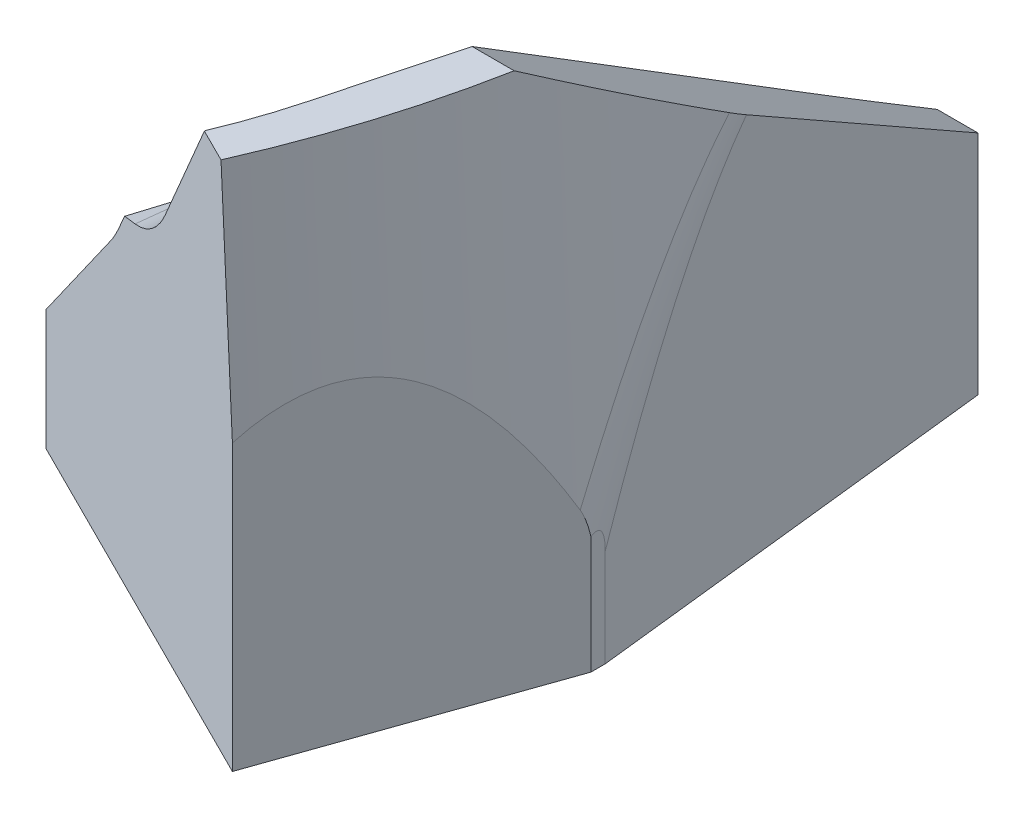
ISO-10303-21;
HEADER;
FILE_DESCRIPTION(('STEP AP214'),'2;1');
FILE_NAME('part.step','',(''),(''),'','','');
FILE_SCHEMA(('AUTOMOTIVE_DESIGN { 1 0 10303 214 1 1 1 1 }'));
ENDSEC;
DATA;
#1=APPLICATION_CONTEXT('core data for automotive mechanical design processes');
#2=APPLICATION_PROTOCOL_DEFINITION('international standard','automotive_design',2000,#1);
#3=PRODUCT_CONTEXT('',#1,'mechanical');
#4=PRODUCT('Part','Part','',(#3));
#5=PRODUCT_RELATED_PRODUCT_CATEGORY('part','',(#4));
#6=PRODUCT_DEFINITION_FORMATION('','',#4);
#7=PRODUCT_DEFINITION_CONTEXT('part definition',#1,'design');
#8=PRODUCT_DEFINITION('design','',#6,#7);
#9=PRODUCT_DEFINITION_SHAPE('','',#8);
#10=(LENGTH_UNIT() NAMED_UNIT(*) SI_UNIT(.MILLI.,.METRE.));
#11=(NAMED_UNIT(*) PLANE_ANGLE_UNIT() SI_UNIT($,.RADIAN.));
#12=(NAMED_UNIT(*) SI_UNIT($,.STERADIAN.) SOLID_ANGLE_UNIT());
#13=UNCERTAINTY_MEASURE_WITH_UNIT(LENGTH_MEASURE(1.E-05),#10,'distance_accuracy_value','');
#14=(GEOMETRIC_REPRESENTATION_CONTEXT(3) GLOBAL_UNCERTAINTY_ASSIGNED_CONTEXT((#13)) GLOBAL_UNIT_ASSIGNED_CONTEXT((#10,
#11,#12)) REPRESENTATION_CONTEXT('',''));
#15=CARTESIAN_POINT('',(0.,0.,0.));
#16=DIRECTION('',(0.,0.,1.));
#17=DIRECTION('',(1.,0.,0.));
#18=AXIS2_PLACEMENT_3D('',#15,#16,#17);
#19=CARTESIAN_POINT('',(0.,69.85,0.));
#20=DIRECTION('',(0.,1.,0.));
#21=DIRECTION('',(0.,0.,1.));
#22=AXIS2_PLACEMENT_3D('',#19,#20,#21);
#23=PLANE('',#22);
#24=CARTESIAN_POINT('',(-112.534011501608,69.85,-10.4906509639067));
#25=DIRECTION('',(0.,-1.,0.));
#26=DIRECTION('',(0.,0.,-1.));
#27=AXIS2_PLACEMENT_3D('',#24,#25,#26);
#28=CIRCLE('',#27,140.377330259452);
#29=CARTESIAN_POINT('',(25.4006313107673,69.85,15.5828828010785));
#30=VERTEX_POINT('',#29);
#31=CARTESIAN_POINT('',(15.9435596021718,69.85,46.0717798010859));
#32=VERTEX_POINT('',#31);
#33=EDGE_CURVE('E204',#30,#32,#28,.T.);
#34=ORIENTED_EDGE('',*,*,#33,.F.);
#35=DIRECTION('',(1.,0.,0.));
#36=VECTOR('',#35,1.);
#37=CARTESIAN_POINT('',(0.,69.85,15.5828828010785));
#38=LINE('',#37,#36);
#39=CARTESIAN_POINT('',(19.673014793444,69.85,15.5828828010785));
#40=VERTEX_POINT('',#39);
#41=EDGE_CURVE('E426',#40,#30,#38,.T.);
#42=ORIENTED_EDGE('',*,*,#41,.F.);
#43=DIRECTION('',(0.257434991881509,0.,-0.966295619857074));
#44=VECTOR('',#43,1.);
#45=CARTESIAN_POINT('',(22.245601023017,69.85,5.92654670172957));
#46=LINE('',#45,#44);
#47=CARTESIAN_POINT('',(14.9899975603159,69.85,33.1608313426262));
#48=VERTEX_POINT('',#47);
#49=EDGE_CURVE('E531',#48,#40,#46,.T.);
#50=ORIENTED_EDGE('',*,*,#49,.F.);
#51=CARTESIAN_POINT('',(-0.298911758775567,69.85,12.9038566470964));
#52=DIRECTION('',(0.,1.,0.));
#53=DIRECTION('',(-0.0838265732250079,0.,0.996480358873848));
#54=AXIS2_PLACEMENT_3D('',#51,#52,#53);
#55=ELLIPSE('',#54,46.3974844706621,18.542);
#56=CARTESIAN_POINT('',(11.4361836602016,69.85,43.6244987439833));
#57=VERTEX_POINT('',#56);
#58=EDGE_CURVE('E84',#48,#57,#55,.F.);
#59=ORIENTED_EDGE('',*,*,#58,.T.);
#60=DIRECTION('',(0.114670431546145,0.,-0.99340358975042));
#61=VECTOR('',#60,1.);
#62=CARTESIAN_POINT('',(16.2552477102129,69.85,1.8763735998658));
#63=LINE('',#62,#61);
#64=CARTESIAN_POINT('',(11.4150562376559,69.85,43.807528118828));
#65=VERTEX_POINT('',#64);
#66=EDGE_CURVE('E12',#65,#57,#63,.T.);
#67=ORIENTED_EDGE('',*,*,#66,.F.);
#68=DIRECTION('',(0.894427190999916,0.,0.447213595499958));
#69=VECTOR('',#68,1.);
#70=CARTESIAN_POINT('',(-15.24,69.85,30.48));
#71=LINE('',#70,#69);
#72=EDGE_CURVE('E220',#65,#32,#71,.T.);
#73=ORIENTED_EDGE('',*,*,#72,.T.);
#74=EDGE_LOOP('',(#34,#42,#50,#59,#67,#73));
#75=FACE_BOUND('',#74,.T.);
#76=ADVANCED_FACE('F60',(#75),#23,.T.);
#77=CARTESIAN_POINT('',(0.,0.,0.));
#78=DIRECTION('',(0.,1.,0.));
#79=DIRECTION('',(0.,0.,1.));
#80=AXIS2_PLACEMENT_3D('',#77,#78,#79);
#81=PLANE('',#80);
#82=DIRECTION('',(0.894427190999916,0.,0.447213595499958));
#83=VECTOR('',#82,1.);
#84=CARTESIAN_POINT('',(-15.24,0.,30.48));
#85=LINE('',#84,#83);
#86=CARTESIAN_POINT('',(-31.75,0.,22.225));
#87=VERTEX_POINT('',#86);
#88=CARTESIAN_POINT('',(19.05,0.,47.625));
#89=VERTEX_POINT('',#88);
#90=EDGE_CURVE('E227',#87,#89,#85,.T.);
#91=ORIENTED_EDGE('',*,*,#90,.F.);
#92=DIRECTION('',(-0.341743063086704,0.,0.939793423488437));
#93=VECTOR('',#92,1.);
#94=CARTESIAN_POINT('',(-20.9040145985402,0.,-7.6014598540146));
#95=LINE('',#94,#93);
#96=CARTESIAN_POINT('',(-6.35000000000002,0.,-47.625));
#97=VERTEX_POINT('',#96);
#98=EDGE_CURVE('E244',#97,#87,#95,.T.);
#99=ORIENTED_EDGE('',*,*,#98,.F.);
#100=DIRECTION('',(-1.,0.,0.));
#101=VECTOR('',#100,1.);
#102=CARTESIAN_POINT('',(-31.75,0.,-47.625));
#103=LINE('',#102,#101);
#104=CARTESIAN_POINT('',(25.4,0.,-47.625));
#105=VERTEX_POINT('',#104);
#106=EDGE_CURVE('E271',#105,#97,#103,.T.);
#107=ORIENTED_EDGE('',*,*,#106,.F.);
#108=DIRECTION('',(0.110431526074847,0.,0.993883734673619));
#109=VECTOR('',#108,1.);
#110=CARTESIAN_POINT('',(30.3173780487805,0.,-3.36859756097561));
#111=LINE('',#110,#109);
#112=CARTESIAN_POINT('',(31.75,0.,9.52499999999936));
#113=VERTEX_POINT('',#112);
#114=EDGE_CURVE('E245',#105,#113,#111,.T.);
#115=ORIENTED_EDGE('',*,*,#114,.T.);
#116=DIRECTION('',(0.,0.,-1.));
#117=VECTOR('',#116,1.);
#118=CARTESIAN_POINT('',(31.75,0.,-47.625));
#119=LINE('',#118,#117);
#120=CARTESIAN_POINT('',(31.75,0.,11.474650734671));
#121=VERTEX_POINT('',#120);
#122=EDGE_CURVE('E255',#121,#113,#119,.T.);
#123=ORIENTED_EDGE('',*,*,#122,.F.);
#124=DIRECTION('',(0.331451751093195,0.,-0.943472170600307));
#125=VECTOR('',#124,1.);
#126=CARTESIAN_POINT('',(31.8502378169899,0.,11.1893253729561));
#127=LINE('',#126,#125);
#128=EDGE_CURVE('E237',#89,#121,#127,.T.);
#129=ORIENTED_EDGE('',*,*,#128,.F.);
#130=EDGE_LOOP('',(#91,#99,#107,#115,#123,#129));
#131=FACE_BOUND('',#130,.T.);
#132=ADVANCED_FACE('F389',(#131),#81,.F.);
#133=CARTESIAN_POINT('',(31.75,69.85,-47.625));
#134=DIRECTION('',(-1.,0.,0.));
#135=DIRECTION('',(0.,0.,1.));
#136=AXIS2_PLACEMENT_3D('',#133,#134,#135);
#137=PLANE('',#136);
#138=DIRECTION('',(0.,1.,0.));
#139=VECTOR('',#138,1.);
#140=CARTESIAN_POINT('',(31.75,0.,9.52500000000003));
#141=LINE('',#140,#139);
#142=CARTESIAN_POINT('',(31.75,13.2893211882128,9.52500000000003));
#143=VERTEX_POINT('',#142);
#144=EDGE_CURVE('E251',#113,#143,#141,.T.);
#145=ORIENTED_EDGE('',*,*,#144,.T.);
#146=CARTESIAN_POINT('',(36.2676383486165,-135.556793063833,50.1837451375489));
#147=CARTESIAN_POINT('',(36.8503005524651,-134.439992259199,55.4277049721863));
#148=CARTESIAN_POINT('',(34.4671756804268,-133.497414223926,60.1730307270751));
#149=CARTESIAN_POINT('',(36.1901198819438,-132.240574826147,49.4860789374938));
#150=CARTESIAN_POINT('',(36.7675078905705,-131.127686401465,54.6825710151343));
#151=CARTESIAN_POINT('',(34.4280588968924,-130.181373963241,59.3950007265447));
#152=CARTESIAN_POINT('',(36.1117514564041,-128.925978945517,48.780763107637));
#153=CARTESIAN_POINT('',(36.6837616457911,-127.814744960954,53.9288548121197));
#154=CARTESIAN_POINT('',(34.3879467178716,-126.867028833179,58.6081561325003));
#155=CARTESIAN_POINT('',(35.9531818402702,-122.300363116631,47.3536365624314));
#156=CARTESIAN_POINT('',(36.5143281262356,-121.192525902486,52.4039531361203));
#157=CARTESIAN_POINT('',(34.3055751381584,-120.242071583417,57.0154586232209));
#158=CARTESIAN_POINT('',(35.8729806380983,-118.989343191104,46.6318257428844));
#159=CARTESIAN_POINT('',(36.42864316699,-117.883230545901,51.6327885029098));
#160=CARTESIAN_POINT('',(34.2633157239,-116.931459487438,56.2096055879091));
#161=CARTESIAN_POINT('',(35.7105754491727,-112.369697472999,45.1701790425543));
#162=CARTESIAN_POINT('',(36.2551500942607,-111.267129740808,50.0713508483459));
#163=CARTESIAN_POINT('',(34.1764733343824,-110.312798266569,54.5771383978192));
#164=CARTESIAN_POINT('',(35.6283705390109,-109.061073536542,44.4303348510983));
#165=CARTESIAN_POINT('',(36.1673434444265,-107.960305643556,49.2810909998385));
#166=CARTESIAN_POINT('',(34.1318892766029,-107.004751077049,53.7505146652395));
#167=CARTESIAN_POINT('',(35.4618385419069,-102.448210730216,42.931546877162));
#168=CARTESIAN_POINT('',(35.9894784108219,-101.35114265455,47.6803056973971));
#169=CARTESIAN_POINT('',(34.0402318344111,-100.393224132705,52.0752536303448));
#170=CARTESIAN_POINT('',(35.3775114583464,-99.143971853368,42.1726031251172));
#171=CARTESIAN_POINT('',(35.8994227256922,-98.0487844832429,46.8698045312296));
#172=CARTESIAN_POINT('',(33.9931584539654,-97.0897443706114,51.2266163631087));
#173=CARTESIAN_POINT('',(35.2052460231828,-92.4897164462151,40.6222142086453));
#174=CARTESIAN_POINT('',(35.7154702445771,-91.3984970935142,45.2142322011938));
#175=CARTESIAN_POINT('',(33.8955693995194,-90.4372182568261,49.4922801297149));
#176=CARTESIAN_POINT('',(35.1172721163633,-89.1397753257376,39.8304490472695));
#177=CARTESIAN_POINT('',(35.6215368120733,-88.0505550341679,44.3688313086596));
#178=CARTESIAN_POINT('',(33.8450119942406,-87.0882503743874,48.6062123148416));
#179=CARTESIAN_POINT('',(34.9387376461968,-82.4455511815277,38.2236388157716));
#180=CARTESIAN_POINT('',(35.430919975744,-81.3604506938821,42.653279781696));
#181=CARTESIAN_POINT('',(33.7408589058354,-80.3961956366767,46.8072402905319));
#182=CARTESIAN_POINT('',(34.8481770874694,-79.101268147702,37.4085937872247));
#183=CARTESIAN_POINT('',(35.3342399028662,-78.0182658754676,41.783159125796));
#184=CARTESIAN_POINT('',(33.6872632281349,-77.0531087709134,45.894336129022));
#185=CARTESIAN_POINT('',(34.6642523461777,-72.4204033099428,35.7532711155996));
#186=CARTESIAN_POINT('',(35.1378962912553,-71.3417282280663,40.0160666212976));
#187=CARTESIAN_POINT('',(33.5767555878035,-70.3748808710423,44.0394272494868));
#188=CARTESIAN_POINT('',(34.5708892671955,-69.0838190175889,34.91300340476));
#189=CARTESIAN_POINT('',(35.0382376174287,-68.0073505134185,39.119138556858));
#190=CARTESIAN_POINT('',(33.519844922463,-67.0397372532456,43.0974339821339));
#191=CARTESIAN_POINT('',(34.3810271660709,-62.4179773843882,33.2042444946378));
#192=CARTESIAN_POINT('',(34.8355798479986,-61.346069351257,37.2952186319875));
#193=CARTESIAN_POINT('',(33.402333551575,-60.3770482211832,41.180905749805));
#194=CARTESIAN_POINT('',(34.2845281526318,-59.0887200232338,32.3357533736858));
#195=CARTESIAN_POINT('',(34.7325847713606,-58.0191398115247,36.3682629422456));
#196=CARTESIAN_POINT('',(33.3417328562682,-57.0495027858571,40.206370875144));
#197=CARTESIAN_POINT('',(34.0691855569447,-51.8006177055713,30.3976700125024));
#198=CARTESIAN_POINT('',(34.5027796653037,-50.7372551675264,34.3000169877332));
#199=CARTESIAN_POINT('',(33.2043944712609,-49.765484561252,38.0305767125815));
#200=CARTESIAN_POINT('',(33.9496074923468,-47.8435482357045,29.3214674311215));
#201=CARTESIAN_POINT('',(34.3751638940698,-46.7831290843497,33.1514750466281));
#202=CARTESIAN_POINT('',(33.1267916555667,-45.8108509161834,36.8216948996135));
#203=CARTESIAN_POINT('',(33.704741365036,-39.9437476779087,27.1176722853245));
#204=CARTESIAN_POINT('',(34.113836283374,-38.8894912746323,30.7995265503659));
#205=CARTESIAN_POINT('',(32.964852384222,-37.9164180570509,34.3446651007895));
#206=CARTESIAN_POINT('',(33.5794531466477,-36.0010169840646,25.9900783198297));
#207=CARTESIAN_POINT('',(33.9801328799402,-34.9499250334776,29.5961959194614));
#208=CARTESIAN_POINT('',(32.8805157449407,-33.9766192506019,33.0765154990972));
#209=CARTESIAN_POINT('',(33.386423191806,-30.097738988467,24.2528087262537));
#210=CARTESIAN_POINT('',(33.7740482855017,-29.0493240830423,27.741434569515));
#211=CARTESIAN_POINT('',(32.7480285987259,-28.0781784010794,31.1213930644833));
#212=CARTESIAN_POINT('',(33.3211848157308,-28.1304673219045,23.6656633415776));
#213=CARTESIAN_POINT('',(33.7044256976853,-27.0837482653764,27.114831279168));
#214=CARTESIAN_POINT('',(32.7028368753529,-26.1125936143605,30.4604083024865));
#215=CARTESIAN_POINT('',(33.1888791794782,-24.2009776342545,22.4749126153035));
#216=CARTESIAN_POINT('',(33.5632257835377,-23.1577319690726,25.8440320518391));
#217=CARTESIAN_POINT('',(32.6102896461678,-22.1866375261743,29.1194510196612));
#218=CARTESIAN_POINT('',(33.1218119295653,-22.2387595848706,21.8713073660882));
#219=CARTESIAN_POINT('',(33.4916498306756,-21.1972827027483,25.1998484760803));
#220=CARTESIAN_POINT('',(32.5629341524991,-20.2262661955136,28.4394786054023));
#221=CARTESIAN_POINT('',(32.9856800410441,-18.3201719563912,20.6461203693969));
#222=CARTESIAN_POINT('',(33.3463619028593,-17.2823219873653,23.8922571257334));
#223=CARTESIAN_POINT('',(32.4658550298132,-16.3115472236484,27.0587935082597));
#224=CARTESIAN_POINT('',(32.9166155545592,-16.3638019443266,20.0245399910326));
#225=CARTESIAN_POINT('',(33.272651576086,-15.3278005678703,23.2288641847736));
#226=CARTESIAN_POINT('',(32.4161315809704,-14.357199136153,26.3580824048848));
#227=CARTESIAN_POINT('',(32.7762795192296,-12.4575581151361,18.7615156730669));
#228=CARTESIAN_POINT('',(33.1228693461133,-11.425353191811,21.88082411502));
#229=CARTESIAN_POINT('',(32.3140673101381,-10.4551928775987,24.9337418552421));
#230=CARTESIAN_POINT('',(32.7050079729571,-10.5076842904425,18.1200717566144));
#231=CARTESIAN_POINT('',(33.0467990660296,-9.47741651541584,21.1961915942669));
#232=CARTESIAN_POINT('',(32.2617264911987,-8.50753469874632,24.2101124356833));
#233=CARTESIAN_POINT('',(32.560601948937,-6.63115877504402,16.8204175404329));
#234=CARTESIAN_POINT('',(32.8926616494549,-5.60484780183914,19.8089548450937));
#235=CARTESIAN_POINT('',(32.1545710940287,-4.6356372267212,22.743372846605));
#236=CARTESIAN_POINT('',(32.4874872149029,-4.70444685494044,16.1623849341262));
#237=CARTESIAN_POINT('',(32.8146178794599,-3.68015497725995,19.106560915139));
#238=CARTESIAN_POINT('',(32.0997799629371,-2.71133596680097,22.0004677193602));
#239=CARTESIAN_POINT('',(32.3385633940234,-0.859554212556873,14.822070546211));
#240=CARTESIAN_POINT('',(32.6556441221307,0.160577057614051,17.6757970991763));
#241=CARTESIAN_POINT('',(31.9869930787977,1.12849762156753,20.486672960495));
#242=CARTESIAN_POINT('',(32.2627542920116,1.05862646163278,14.1397886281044));
#243=CARTESIAN_POINT('',(32.5747160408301,2.07662955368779,16.9474443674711));
#244=CARTESIAN_POINT('',(31.92899730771,3.04402990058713,19.7157831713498));
#245=CARTESIAN_POINT('',(32.1080694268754,4.88563382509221,12.7476248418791));
#246=CARTESIAN_POINT('',(32.4095731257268,5.89924027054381,15.4611581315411));
#247=CARTESIAN_POINT('',(31.8093633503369,6.86547048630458,18.1421540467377));
#248=CARTESIAN_POINT('',(32.0291925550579,6.7944568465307,12.0377329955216));
#249=CARTESIAN_POINT('',(32.325359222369,7.80581065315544,14.7032330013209));
#250=CARTESIAN_POINT('',(31.7477238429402,8.77137502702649,17.3394031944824));
#251=CARTESIAN_POINT('',(31.8679742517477,10.6000646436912,10.5867682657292));
#252=CARTESIAN_POINT('',(32.153215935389,11.606753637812,13.1539434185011));
#253=CARTESIAN_POINT('',(31.620307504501,12.570838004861,15.6979072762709));
#254=CARTESIAN_POINT('',(31.7856328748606,12.4968496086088,9.84569587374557));
#255=CARTESIAN_POINT('',(32.065289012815,13.5011443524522,12.3626011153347));
#256=CARTESIAN_POINT('',(31.5545307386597,14.4643966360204,14.8591627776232));
#257=CARTESIAN_POINT('',(31.6171441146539,16.2714677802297,8.32929703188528));
#258=CARTESIAN_POINT('',(31.8853500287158,17.2707970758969,10.7431502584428));
#259=CARTESIAN_POINT('',(31.4183462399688,18.2322131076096,13.1420872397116));
#260=CARTESIAN_POINT('',(31.5310059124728,18.1493345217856,7.55405321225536));
#261=CARTESIAN_POINT('',(31.7933506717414,19.1461110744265,9.91515604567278));
#262=CARTESIAN_POINT('',(31.3479494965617,20.1065053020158,12.263851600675));
#263=CARTESIAN_POINT('',(31.3540629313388,21.8872202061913,5.96156638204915));
#264=CARTESIAN_POINT('',(31.6043417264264,22.8786731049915,8.21407553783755));
#265=CARTESIAN_POINT('',(31.2015577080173,23.8368239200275,10.458883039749));
#266=CARTESIAN_POINT('',(31.2632578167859,23.7472378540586,5.14432035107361));
#267=CARTESIAN_POINT('',(31.5073348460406,24.7359456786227,7.34101361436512));
#268=CARTESIAN_POINT('',(31.1255622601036,25.6928490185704,9.53214663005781));
#269=CARTESIAN_POINT('',(31.1229123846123,26.5193327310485,3.88121146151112));
#270=CARTESIAN_POINT('',(31.3573516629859,27.5042315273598,5.99116496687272));
#271=CARTESIAN_POINT('',(31.0065731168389,28.4585803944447,8.09902316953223));
#272=CARTESIAN_POINT('',(31.0754568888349,27.4400822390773,3.45411199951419));
#273=CARTESIAN_POINT('',(31.3066432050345,28.4235162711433,5.53478884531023));
#274=CARTESIAN_POINT('',(30.9660912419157,29.3771470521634,7.61430849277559));
#275=CARTESIAN_POINT('',(30.9790145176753,29.274973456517,2.58613065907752));
#276=CARTESIAN_POINT('',(31.2035810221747,30.255408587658,4.6072291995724));
#277=CARTESIAN_POINT('',(30.8832787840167,31.2075339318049,6.62895793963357));
#278=CARTESIAN_POINT('',(30.9300276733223,30.1891152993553,2.14524905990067));
#279=CARTESIAN_POINT('',(31.151227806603,31.1680208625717,4.13605025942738));
#280=CARTESIAN_POINT('',(30.8409482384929,32.1193542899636,6.12832238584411));
#281=CARTESIAN_POINT('',(30.8303669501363,32.0096546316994,1.24830255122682));
#282=CARTESIAN_POINT('',(31.0447082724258,32.9854242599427,3.17737445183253));
#283=CARTESIAN_POINT('',(30.7542434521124,33.9350970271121,5.10950800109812));
#284=CARTESIAN_POINT('',(30.779693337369,32.9160533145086,0.792240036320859));
#285=CARTESIAN_POINT('',(30.9905427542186,33.8902217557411,2.6898847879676));
#286=CARTESIAN_POINT('',(30.7098695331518,34.8390206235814,4.59133193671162));
#287=CARTESIAN_POINT('',(30.6764591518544,34.7199751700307,-0.136867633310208));
#288=CARTESIAN_POINT('',(30.8801831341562,35.6908548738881,1.69664820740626));
#289=CARTESIAN_POINT('',(30.6188324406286,36.6378200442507,3.5353556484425));
#290=CARTESIAN_POINT('',(30.6238986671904,35.6174987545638,-0.609911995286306));
#291=CARTESIAN_POINT('',(30.823989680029,36.5866968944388,1.19090712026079));
#292=CARTESIAN_POINT('',(30.5721693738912,37.5326962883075,2.99755634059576));
#293=CARTESIAN_POINT('',(30.5537639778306,36.7845974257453,-1.2411241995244));
#294=CARTESIAN_POINT('',(30.7489893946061,37.7516744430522,0.51590455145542));
#295=CARTESIAN_POINT('',(30.5094478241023,38.6962050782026,2.27970219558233));
#296=CARTESIAN_POINT('',(30.537148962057,37.0589151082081,-1.39065934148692));
#297=CARTESIAN_POINT('',(30.7312232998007,38.0254549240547,0.356009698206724));
#298=CARTESIAN_POINT('',(30.4945565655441,38.9696682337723,2.10962470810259));
#299=CARTESIAN_POINT('',(30.5037094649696,37.6065056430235,-1.69161481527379));
#300=CARTESIAN_POINT('',(30.6954658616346,38.5719617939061,0.0341927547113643));
#301=CARTESIAN_POINT('',(30.4645190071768,39.5155304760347,1.76729082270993));
#302=CARTESIAN_POINT('',(30.4868849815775,37.8797784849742,-1.84303516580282));
#303=CARTESIAN_POINT('',(30.6774745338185,38.8446883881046,-0.127729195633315));
#304=CARTESIAN_POINT('',(30.4493727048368,39.7879295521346,1.59503440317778));
#305=CARTESIAN_POINT('',(30.4360834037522,38.6979744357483,-2.30024936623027));
#306=CARTESIAN_POINT('',(30.623150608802,39.6611870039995,-0.61664452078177));
#307=CARTESIAN_POINT('',(30.4035344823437,40.6034740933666,1.07485198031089));
#308=CARTESIAN_POINT('',(30.4017801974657,39.2412413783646,-2.60897822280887));
#309=CARTESIAN_POINT('',(30.586464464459,40.2033339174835,-0.946819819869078));
#310=CARTESIAN_POINT('',(30.3724450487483,41.1449333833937,0.723533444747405));
#311=CARTESIAN_POINT('',(30.3322275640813,40.3229161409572,-3.23495192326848));
#312=CARTESIAN_POINT('',(30.5120742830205,41.2827257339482,-1.61633145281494));
#313=CARTESIAN_POINT('',(30.3091119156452,42.2229056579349,0.0110523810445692));
#314=CARTESIAN_POINT('',(30.296977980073,40.8613231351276,-3.55219817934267));
#315=CARTESIAN_POINT('',(30.4743702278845,41.8199718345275,-1.95566794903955));
#316=CARTESIAN_POINT('',(30.2768680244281,42.7594178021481,-0.350111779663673));
#317=CARTESIAN_POINT('',(30.2254574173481,41.9325190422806,-4.19588324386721));
#318=CARTESIAN_POINT('',(30.3978630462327,42.8887991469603,-2.64423258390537));
#319=CARTESIAN_POINT('',(30.2111286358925,43.8267291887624,-1.08306911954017));
#320=CARTESIAN_POINT('',(30.1891864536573,42.4653080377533,-4.52232191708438));
#321=CARTESIAN_POINT('',(30.3590600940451,43.4203826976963,-2.99345915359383));
#322=CARTESIAN_POINT('',(30.1776331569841,44.3575285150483,-1.45486214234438));
#323=CARTESIAN_POINT('',(30.0794835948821,44.0430308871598,-5.50964764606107));
#324=CARTESIAN_POINT('',(30.2417005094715,44.9942773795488,-4.04969541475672));
#325=CARTESIAN_POINT('',(30.0758205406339,45.929170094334,-2.57962431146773));
#326=CARTESIAN_POINT('',(30.004426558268,45.0788358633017,-6.18516097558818));
#327=CARTESIAN_POINT('',(30.1613836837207,46.0275623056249,-4.77254684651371));
#328=CARTESIAN_POINT('',(30.0055090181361,46.9607322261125,-3.34950687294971));
#329=CARTESIAN_POINT('',(29.8879197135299,46.608092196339,-7.23372257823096));
#330=CARTESIAN_POINT('',(30.036672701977,47.5530028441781,-5.89494568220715));
#331=CARTESIAN_POINT('',(29.8951927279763,48.4832547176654,-4.54516024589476));
#332=CARTESIAN_POINT('',(29.8484268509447,47.113813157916,-7.58915834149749));
#333=CARTESIAN_POINT('',(29.9943990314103,48.0573731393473,-6.27540871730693));
#334=CARTESIAN_POINT('',(29.8576088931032,48.9866692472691,-4.95055429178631));
#335=CARTESIAN_POINT('',(29.7679940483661,48.1157254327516,-8.31305356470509));
#336=CARTESIAN_POINT('',(29.9082929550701,49.0565161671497,-7.05036340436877));
#337=CARTESIAN_POINT('',(29.7806440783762,49.9838313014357,-5.77641376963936));
#338=CARTESIAN_POINT('',(29.7270541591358,48.6119170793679,-8.6815125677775));
#339=CARTESIAN_POINT('',(29.8644607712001,49.5512928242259,-7.44485305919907));
#340=CARTESIAN_POINT('',(29.7412631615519,50.4775791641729,-6.19687867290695));
#341=CARTESIAN_POINT('',(29.6270594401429,49.7872556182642,-9.58146503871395));
#342=CARTESIAN_POINT('',(29.7573927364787,50.7231058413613,-8.40846537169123));
#343=CARTESIAN_POINT('',(29.6445282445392,51.6468798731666,-7.22413768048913));
#344=CARTESIAN_POINT('',(29.5672448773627,50.4611336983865,-10.1197961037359));
#345=CARTESIAN_POINT('',(29.6933345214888,51.3948926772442,-8.98498930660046));
#346=CARTESIAN_POINT('',(29.5862266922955,52.3170912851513,-7.83884655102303));
#347=CARTESIAN_POINT('',(29.4440286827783,51.7809204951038,-11.228741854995));
#348=CARTESIAN_POINT('',(29.5613508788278,52.7103222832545,-10.1728420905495));
#349=CARTESIAN_POINT('',(29.4651030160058,53.6291959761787,-9.10565804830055));
#350=CARTESIAN_POINT('',(29.3806295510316,52.4268481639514,-11.7993340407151));
#351=CARTESIAN_POINT('',(29.4934285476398,53.3539977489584,-10.7841430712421));
#352=CARTESIAN_POINT('',(29.4022840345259,54.2711084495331,-9.75773461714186));
#353=CARTESIAN_POINT('',(29.282082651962,53.3713205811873,-12.6862561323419));
#354=CARTESIAN_POINT('',(29.3878210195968,54.2949833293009,-11.7346108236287));
#355=CARTESIAN_POINT('',(29.3037465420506,55.2092273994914,-10.7717767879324));
#356=CARTESIAN_POINT('',(29.2485078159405,53.6833568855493,-12.9884296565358));
#357=CARTESIAN_POINT('',(29.3518391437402,54.6058075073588,-12.0584477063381));
#358=CARTESIAN_POINT('',(29.2700288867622,55.5190807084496,-11.1173355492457));
#359=CARTESIAN_POINT('',(29.1801943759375,54.2967546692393,-13.6032506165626));
#360=CARTESIAN_POINT('',(29.2786196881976,55.2167246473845,-12.7174228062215));
#361=CARTESIAN_POINT('',(29.2011027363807,56.1279962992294,-11.8205974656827));
#362=CARTESIAN_POINT('',(29.1454559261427,54.5981175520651,-13.9158966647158));
#363=CARTESIAN_POINT('',(29.2413822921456,55.5168215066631,-13.0525593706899));
#364=CARTESIAN_POINT('',(29.1658944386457,56.427059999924,-12.1782990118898));
#365=CARTESIAN_POINT('',(29.0746421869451,55.189134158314,-14.5532203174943));
#366=CARTESIAN_POINT('',(29.1654650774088,56.1052417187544,-13.7358143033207));
#367=CARTESIAN_POINT('',(29.093773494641,57.0133457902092,-12.9076483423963));
#368=CARTESIAN_POINT('',(29.0385642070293,55.4787615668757,-14.8779221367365));
#369=CARTESIAN_POINT('',(29.12678233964,56.393541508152,-14.0839589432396));
#370=CARTESIAN_POINT('',(29.0568573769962,57.3005412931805,-13.2793242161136));
#371=CARTESIAN_POINT('',(28.9650250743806,56.0435363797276,-15.5397743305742));
#372=CARTESIAN_POINT('',(29.0479232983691,56.9555923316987,-14.7936903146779));
#373=CARTESIAN_POINT('',(28.9812261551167,57.8603107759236,-14.0371239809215));
#374=CARTESIAN_POINT('',(28.9275632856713,56.3186769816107,-15.8769304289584));
#375=CARTESIAN_POINT('',(29.0077462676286,57.2293397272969,-15.1552835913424));
#376=CARTESIAN_POINT('',(28.9425102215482,58.1328778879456,-14.4232545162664));
#377=CARTESIAN_POINT('',(28.8893681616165,56.585393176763,-16.2206865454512));
#378=CARTESIAN_POINT('',(28.9667746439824,57.4946411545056,-15.5240282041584));
#379=CARTESIAN_POINT('',(28.902829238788,58.3969441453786,-14.8170509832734));
#380=(BOUNDED_SURFACE() B_SPLINE_SURFACE(3,2,((#146,#147,#148),(#149,#150,#151),(#152,#153,
#154),(#155,#156,#157),(#158,#159,#160),(#161,#162,#163),(#164,#165,#166),(#167,#168,#169),
(#170,#171,#172),(#173,#174,#175),(#176,#177,#178),(#179,#180,#181),(#182,#183,#184),(#185,#186,
#187),(#188,#189,#190),(#191,#192,#193),(#194,#195,#196),(#197,#198,#199),(#200,#201,#202),
(#203,#204,#205),(#206,#207,#208),(#209,#210,#211),(#212,#213,#214),(#215,#216,#217),(#218,#219,
#220),(#221,#222,#223),(#224,#225,#226),(#227,#228,#229),(#230,#231,#232),(#233,#234,#235),
(#236,#237,#238),(#239,#240,#241),(#242,#243,#244),(#245,#246,#247),(#248,#249,#250),(#251,#252,
#253),(#254,#255,#256),(#257,#258,#259),(#260,#261,#262),(#263,#264,#265),(#266,#267,#268),
(#269,#270,#271),(#272,#273,#274),(#275,#276,#277),(#278,#279,#280),(#281,#282,#283),(#284,#285,
#286),(#287,#288,#289),(#290,#291,#292),(#293,#294,#295),(#296,#297,#298),(#299,#300,#301),
(#302,#303,#304),(#305,#306,#307),(#308,#309,#310),(#311,#312,#313),(#314,#315,#316),(#317,#318,
#319),(#320,#321,#322),(#323,#324,#325),(#326,#327,#328),(#329,#330,#331),(#332,#333,#334),
(#335,#336,#337),(#338,#339,#340),(#341,#342,#343),(#344,#345,#346),(#347,#348,#349),(#350,#351,
#352),(#353,#354,#355),(#356,#357,#358),(#359,#360,#361),(#362,#363,#364),(#365,#366,#367),
(#368,#369,#370),(#371,#372,#373),(#374,#375,#376),(#377,#378,#379)),.UNSPECIFIED.,.F.,.F.,
.F.) B_SPLINE_SURFACE_WITH_KNOTS((4,2,2,2,2,2,2,2,2,2,2,2,2,2,2,2,2,2,2,2,2,2,2,2,2,2,2,2,2,2,2,
2,2,2,2,2,2,2,4),(3,3),(0.,10.1690939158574,20.3382520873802,30.5121887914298,40.6861092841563,
51.0161160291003,61.3461043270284,71.6720768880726,81.9980207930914,94.3053765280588,
106.613067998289,112.775182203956,118.937261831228,125.098873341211,131.260477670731,
137.37221825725,143.483993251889,149.597997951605,155.711906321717,161.811764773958,
167.912062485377,170.960249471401,174.008374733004,177.056021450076,180.103526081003,
181.04212758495,181.980738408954,183.858074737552,185.735724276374,187.61334620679,
191.328706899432,193.186718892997,195.044665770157,197.637547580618,200.228642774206,
201.535422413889,202.842029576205,204.151420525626,205.461420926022),(0.,1.),
.UNSPECIFIED.) GEOMETRIC_REPRESENTATION_ITEM() RATIONAL_B_SPLINE_SURFACE(((1.,0.960207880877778,
1.),(1.,0.960868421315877,1.),(1.,0.961528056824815,1.),(1.,0.962845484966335,1.),(1.,
0.963503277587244,1.),(1.,0.964817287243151,1.),(1.,0.965473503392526,1.),(1.,0.966784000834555,
1.),(1.,0.96743828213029,1.),(1.,0.968754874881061,1.),(1.,0.969417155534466,1.),(1.,
0.970739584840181,1.),(1.,0.971399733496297,1.),(1.,0.97271754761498,1.),(1.,0.973375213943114,
1.),(1.,0.974688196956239,1.),(1.,0.975343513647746,1.),(1.,0.976777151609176,1.),(1.,
0.977554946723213,1.),(1.,0.979106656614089,1.),(1.,0.979880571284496,1.),(1.,0.981038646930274,
1.),(1.,0.981424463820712,1.),(1.,0.982194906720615,1.),(1.,0.982579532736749,1.),(1.,
0.983347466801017,1.),(1.,0.983730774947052,1.),(1.,0.98449597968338,1.),(1.,0.984877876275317,
1.),(1.,0.985637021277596,1.),(1.,0.986014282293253,1.),(1.,0.986767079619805,1.),(1.,
0.987142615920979,1.),(1.,0.987891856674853,1.),(1.,0.988265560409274,1.),(1.,0.989010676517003,
1.),(1.,0.989382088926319,1.),(1.,0.990121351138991,1.),(1.,0.990489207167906,1.),(1.,
0.991221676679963,1.),(1.,0.991586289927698,1.),(1.,0.992129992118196,1.),(1.,0.992310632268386,
1.),(1.,0.992670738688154,1.),(1.,0.992850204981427,1.),(1.,0.993207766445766,1.),(1.,
0.993385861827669,1.),(1.,0.993740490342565,1.),(1.,0.993917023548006,1.),(1.,0.99414672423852,
1.),(1.,0.994200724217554,1.),(1.,0.994308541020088,1.),(1.,0.994362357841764,1.),(1.,
0.994523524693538,1.),(1.,0.994630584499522,1.),(1.,0.994843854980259,1.),(1.,0.994950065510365,
1.),(1.,0.995161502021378,1.),(1.,0.995266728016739,1.),(1.,0.995578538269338,1.),(1.,
0.995783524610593,1.),(1.,0.996086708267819,1.),(1.,0.996187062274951,1.),(1.,0.996386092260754,
1.),(1.,0.996484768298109,1.),(1.,0.996718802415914,1.),(1.,0.996853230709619,1.),(1.,
0.997117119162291,1.),(1.,0.997246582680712,1.),(1.,0.997436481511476,1.),(1.,0.997499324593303,
1.),(1.,0.997623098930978,1.),(1.,0.997684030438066,1.),(1.,0.997803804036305,1.),(1.,
0.997862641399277,1.),(1.,0.997977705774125,1.),(1.,0.998033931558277,1.),(1.,0.998088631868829,1.))) REPRESENTATION_ITEM('') SURFACE());
#381=CARTESIAN_POINT('',(31.75,13.2893211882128,9.5250000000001));
#382=CARTESIAN_POINT('',(31.75,13.3907551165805,9.5250135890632));
#383=CARTESIAN_POINT('',(31.75,13.4922000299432,9.52603782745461));
#384=CARTESIAN_POINT('',(31.75,13.6951385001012,9.53055430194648));
#385=CARTESIAN_POINT('',(31.75,13.7966319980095,9.53404909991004));
#386=CARTESIAN_POINT('',(31.75,14.1095433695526,9.54932992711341));
#387=CARTESIAN_POINT('',(31.75,14.3207341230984,9.56599787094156));
#388=CARTESIAN_POINT('',(31.75,14.7419148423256,9.61883919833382));
#389=CARTESIAN_POINT('',(31.75,14.9518991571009,9.65507210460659));
#390=CARTESIAN_POINT('',(31.75,15.2584945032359,9.73550964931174));
#391=CARTESIAN_POINT('',(31.75,15.3585204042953,9.76631900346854));
#392=CARTESIAN_POINT('',(31.75,15.5537965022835,9.84025177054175));
#393=CARTESIAN_POINT('',(31.75,15.6490656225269,9.88332089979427));
#394=CARTESIAN_POINT('',(31.75,15.7907218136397,9.96480624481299));
#395=CARTESIAN_POINT('',(31.75,15.8404963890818,9.99724355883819));
#396=CARTESIAN_POINT('',(31.75,15.9347854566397,10.069086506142));
#397=CARTESIAN_POINT('',(31.75,15.9793088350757,10.1084800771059));
#398=CARTESIAN_POINT('',(31.75,16.0514144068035,10.185382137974));
#399=CARTESIAN_POINT('',(31.75,16.0805690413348,10.2214005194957));
#400=CARTESIAN_POINT('',(31.75,16.1324197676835,10.2978416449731));
#401=CARTESIAN_POINT('',(31.75,16.1551205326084,10.3382611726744));
#402=CARTESIAN_POINT('',(31.75,16.1930058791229,10.4226561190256));
#403=CARTESIAN_POINT('',(31.75,16.208165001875,10.4666430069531));
#404=CARTESIAN_POINT('',(31.75,16.2305485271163,10.5565490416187));
#405=CARTESIAN_POINT('',(31.75,16.2377728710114,10.602468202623));
#406=CARTESIAN_POINT('',(31.75,16.2459976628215,10.707404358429));
#407=CARTESIAN_POINT('',(31.75,16.2447696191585,10.7665853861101));
#408=CARTESIAN_POINT('',(31.75,16.2329480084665,10.8842738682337));
#409=CARTESIAN_POINT('',(31.75,16.2222891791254,10.9427737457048));
#410=CARTESIAN_POINT('',(31.75,16.1875749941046,11.0842155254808));
#411=CARTESIAN_POINT('',(31.75,16.1596284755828,11.1661489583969));
#412=CARTESIAN_POINT('',(31.75,16.0944302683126,11.3242279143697));
#413=CARTESIAN_POINT('',(31.75,16.0573945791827,11.400460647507));
#414=CARTESIAN_POINT('',(31.75,16.0177697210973,11.474650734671));
#415=B_SPLINE_CURVE_WITH_KNOTS('',3,(#381,#382,#383,#384,#385,#386,#387,#388,#389,#390,#391,
#392,#393,#394,#395,#396,#397,#398,#399,#400,#401,#402,#403,#404,#405,#406,#407,#408,#409,#410,
#411,#412,#413,#414),.UNSPECIFIED.,.F.,.F.,(4,2,2,2,2,2,2,2,2,2,2,2,2,2,2,2,4),(0.,
0.304313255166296,0.608942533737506,1.24413429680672,1.88126948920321,2.19480779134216,
2.50697884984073,2.68476057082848,2.86223698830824,3.00068953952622,3.13904158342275,
3.27785755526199,3.41667455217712,3.59326489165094,3.77108690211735,4.0299329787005,
4.28313951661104),.UNSPECIFIED.);
#416=CARTESIAN_POINT('',(31.75,16.0177697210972,11.474650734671));
#417=VERTEX_POINT('',#416);
#418=EDGE_CURVE('E343',#143,#417,#415,.T.);
#419=ORIENTED_EDGE('',*,*,#418,.T.);
#420=DIRECTION('',(0.,1.,0.));
#421=VECTOR('',#420,1.);
#422=CARTESIAN_POINT('',(31.75,0.,11.474650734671));
#423=LINE('',#422,#421);
#424=EDGE_CURVE('E240',#121,#417,#423,.T.);
#425=ORIENTED_EDGE('',*,*,#424,.F.);
#426=ORIENTED_EDGE('',*,*,#122,.T.);
#427=EDGE_LOOP('',(#145,#419,#425,#426));
#428=FACE_BOUND('',#427,.T.);
#429=ADVANCED_FACE('F394',(#428),#137,.F.);
#430=CARTESIAN_POINT('',(-31.75,69.85,-47.625));
#431=DIRECTION('',(0.,0.,1.));
#432=DIRECTION('',(1.,0.,0.));
#433=AXIS2_PLACEMENT_3D('',#430,#431,#432);
#434=PLANE('',#433);
#435=DIRECTION('',(-0.595225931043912,-0.803558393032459,0.));
#436=VECTOR('',#435,1.);
#437=CARTESIAN_POINT('',(6.34999999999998,21.59,-47.625));
#438=LINE('',#437,#436);
#439=CARTESIAN_POINT('',(3.73812152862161,18.0639492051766,-47.625));
#440=VERTEX_POINT('',#439);
#441=CARTESIAN_POINT('',(-5.38344854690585,5.74977771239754,-47.625));
#442=VERTEX_POINT('',#441);
#443=EDGE_CURVE('E513',#440,#442,#438,.T.);
#444=ORIENTED_EDGE('',*,*,#443,.F.);
#445=CARTESIAN_POINT('',(18.3817003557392,5.04869313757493,-47.625));
#446=DIRECTION('',(0.,0.,1.));
#447=DIRECTION('',(0.18882150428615,-0.982011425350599,0.));
#448=AXIS2_PLACEMENT_3D('',#445,#446,#447);
#449=ELLIPSE('',#448,20.2988994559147,18.542);
#450=CARTESIAN_POINT('',(10.1460577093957,23.4880288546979,-47.625));
#451=VERTEX_POINT('',#450);
#452=EDGE_CURVE('E465',#440,#451,#449,.F.);
#453=ORIENTED_EDGE('',*,*,#452,.T.);
#454=DIRECTION('',(-0.894427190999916,-0.447213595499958,0.));
#455=VECTOR('',#454,1.);
#456=CARTESIAN_POINT('',(19.05,27.94,-47.625));
#457=LINE('',#456,#455);
#458=CARTESIAN_POINT('',(13.0285789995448,24.9292894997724,-47.625));
#459=VERTEX_POINT('',#458);
#460=EDGE_CURVE('E512',#459,#451,#457,.T.);
#461=ORIENTED_EDGE('',*,*,#460,.F.);
#462=CARTESIAN_POINT('',(4.7929363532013,43.3686252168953,-47.625));
#463=DIRECTION('',(0.,0.,1.));
#464=DIRECTION('',(-0.188821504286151,0.982011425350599,0.));
#465=AXIS2_PLACEMENT_3D('',#462,#463,#464);
#466=ELLIPSE('',#465,20.2988994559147,18.542);
#467=CARTESIAN_POINT('',(19.8299267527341,30.9046223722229,-47.625));
#468=VERTEX_POINT('',#467);
#469=EDGE_CURVE('E483',#459,#468,#466,.T.);
#470=ORIENTED_EDGE('',*,*,#469,.T.);
#471=DIRECTION('',(-1.,0.,0.));
#472=VECTOR('',#471,1.);
#473=CARTESIAN_POINT('',(52.8569373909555,30.9046223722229,-47.625));
#474=LINE('',#473,#472);
#475=CARTESIAN_POINT('',(25.4,30.9046223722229,-47.625));
#476=VERTEX_POINT('',#475);
#477=EDGE_CURVE('E320',#476,#468,#474,.T.);
#478=ORIENTED_EDGE('',*,*,#477,.F.);
#479=DIRECTION('',(0.,1.,0.));
#480=VECTOR('',#479,1.);
#481=CARTESIAN_POINT('',(25.4,0.,-47.625));
#482=LINE('',#481,#480);
#483=EDGE_CURVE('E249',#105,#476,#482,.T.);
#484=ORIENTED_EDGE('',*,*,#483,.F.);
#485=ORIENTED_EDGE('',*,*,#106,.T.);
#486=DIRECTION('',(0.,1.,0.));
#487=VECTOR('',#486,1.);
#488=CARTESIAN_POINT('',(-6.35000000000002,0.,-47.625));
#489=LINE('',#488,#487);
#490=CARTESIAN_POINT('',(-6.35000000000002,4.55024848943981,-47.625));
#491=VERTEX_POINT('',#490);
#492=EDGE_CURVE('E262',#97,#491,#489,.T.);
#493=ORIENTED_EDGE('',*,*,#492,.T.);
#494=CARTESIAN_POINT('',(-20.0270273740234,18.7650337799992,-47.625));
#495=DIRECTION('',(0.,0.,1.));
#496=DIRECTION('',(-0.18882150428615,0.982011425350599,0.));
#497=AXIS2_PLACEMENT_3D('',#494,#495,#496);
#498=ELLIPSE('',#497,20.2988994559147,18.542);
#499=EDGE_CURVE('E471',#491,#442,#498,.T.);
#500=ORIENTED_EDGE('',*,*,#499,.T.);
#501=EDGE_LOOP('',(#444,#453,#461,#470,#478,#484,#485,#493,#500));
#502=FACE_BOUND('',#501,.T.);
#503=ADVANCED_FACE('F398',(#502),#434,.F.);
#504=CARTESIAN_POINT('',(30.3173780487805,0.,-3.36859756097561));
#505=DIRECTION('',(-0.993883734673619,0.,0.110431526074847));
#506=DIRECTION('',(0.110431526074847,0.,0.993883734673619));
#507=AXIS2_PLACEMENT_3D('',#504,#505,#506);
#508=PLANE('',#507);
#509=DIRECTION('',(0.094176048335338,0.522237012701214,0.847584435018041));
#510=VECTOR('',#509,1.);
#511=CARTESIAN_POINT('',(27.456296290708,42.3074583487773,-29.1183333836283));
#512=LINE('',#511,#510);
#513=CARTESIAN_POINT('',(29.3440008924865,52.7753982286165,-12.1289919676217));
#514=VERTEX_POINT('',#513);
#515=EDGE_CURVE('E422',#476,#514,#512,.T.);
#516=ORIENTED_EDGE('',*,*,#515,.T.);
#517=CARTESIAN_POINT('',(28.8893681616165,56.585393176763,-16.2206865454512));
#518=CARTESIAN_POINT('',(28.9275632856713,56.3186769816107,-15.8769304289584));
#519=CARTESIAN_POINT('',(28.9650250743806,56.0435363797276,-15.5397743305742));
#520=CARTESIAN_POINT('',(29.0385642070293,55.4787615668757,-14.8779221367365));
#521=CARTESIAN_POINT('',(29.0746421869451,55.189134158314,-14.5532203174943));
#522=CARTESIAN_POINT('',(29.1454559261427,54.5981175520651,-13.9158966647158));
#523=CARTESIAN_POINT('',(29.1801943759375,54.2967546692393,-13.6032506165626));
#524=CARTESIAN_POINT('',(29.2485078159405,53.6833568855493,-12.9884296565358));
#525=CARTESIAN_POINT('',(29.282082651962,53.3713205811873,-12.6862561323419));
#526=CARTESIAN_POINT('',(29.3806295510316,52.4268481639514,-11.7993340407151));
#527=CARTESIAN_POINT('',(29.4440286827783,51.7809204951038,-11.228741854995));
#528=CARTESIAN_POINT('',(29.5672448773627,50.4611336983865,-10.1197961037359));
#529=CARTESIAN_POINT('',(29.6270594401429,49.7872556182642,-9.58146503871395));
#530=CARTESIAN_POINT('',(29.7270541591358,48.6119170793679,-8.6815125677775));
#531=CARTESIAN_POINT('',(29.7679940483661,48.1157254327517,-8.31305356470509));
#532=CARTESIAN_POINT('',(29.8484268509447,47.113813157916,-7.58915834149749));
#533=CARTESIAN_POINT('',(29.8879197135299,46.608092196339,-7.23372257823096));
#534=CARTESIAN_POINT('',(30.004426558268,45.0788358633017,-6.18516097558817));
#535=CARTESIAN_POINT('',(30.0794835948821,44.0430308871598,-5.50964764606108));
#536=CARTESIAN_POINT('',(30.1891864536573,42.4653080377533,-4.52232191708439));
#537=CARTESIAN_POINT('',(30.2254574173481,41.9325190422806,-4.19588324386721));
#538=CARTESIAN_POINT('',(30.296977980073,40.8613231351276,-3.55219817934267));
#539=CARTESIAN_POINT('',(30.3322275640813,40.3229161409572,-3.23495192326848));
#540=CARTESIAN_POINT('',(30.4017801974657,39.2412413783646,-2.60897822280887));
#541=CARTESIAN_POINT('',(30.4360834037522,38.6979744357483,-2.30024936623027));
#542=CARTESIAN_POINT('',(30.4868849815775,37.8797784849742,-1.84303516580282));
#543=CARTESIAN_POINT('',(30.5037094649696,37.6065056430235,-1.69161481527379));
#544=CARTESIAN_POINT('',(30.537148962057,37.0589151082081,-1.39065934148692));
#545=CARTESIAN_POINT('',(30.5537639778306,36.7845974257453,-1.2411241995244));
#546=CARTESIAN_POINT('',(30.6238986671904,35.6174987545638,-0.609911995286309));
#547=CARTESIAN_POINT('',(30.6764591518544,34.7199751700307,-0.13686763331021));
#548=CARTESIAN_POINT('',(30.779693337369,32.9160533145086,0.79224003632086));
#549=CARTESIAN_POINT('',(30.8303669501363,32.0096546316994,1.24830255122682));
#550=CARTESIAN_POINT('',(30.9300276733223,30.1891152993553,2.14524905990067));
#551=CARTESIAN_POINT('',(30.9790145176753,29.274973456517,2.58613065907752));
#552=CARTESIAN_POINT('',(31.0754568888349,27.4400822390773,3.45411199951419));
#553=CARTESIAN_POINT('',(31.1229123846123,26.5193327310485,3.88121146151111));
#554=CARTESIAN_POINT('',(31.263257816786,23.7472378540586,5.14432035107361));
#555=CARTESIAN_POINT('',(31.3540629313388,21.8872202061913,5.96156638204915));
#556=CARTESIAN_POINT('',(31.5310059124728,18.1493345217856,7.55405321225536));
#557=CARTESIAN_POINT('',(31.6171441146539,16.2714677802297,8.32929703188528));
#558=CARTESIAN_POINT('',(31.7856328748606,12.4968496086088,9.84569587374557));
#559=CARTESIAN_POINT('',(31.8679742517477,10.6000646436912,10.5867682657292));
#560=CARTESIAN_POINT('',(32.0291925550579,6.7944568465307,12.0377329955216));
#561=CARTESIAN_POINT('',(32.1080694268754,4.88563382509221,12.7476248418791));
#562=CARTESIAN_POINT('',(32.2627542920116,1.05862646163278,14.1397886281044));
#563=CARTESIAN_POINT('',(32.3385633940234,-0.859554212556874,14.822070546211));
#564=CARTESIAN_POINT('',(32.4874872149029,-4.70444685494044,16.1623849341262));
#565=CARTESIAN_POINT('',(32.560601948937,-6.63115877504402,16.8204175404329));
#566=CARTESIAN_POINT('',(32.7050079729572,-10.5076842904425,18.1200717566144));
#567=CARTESIAN_POINT('',(32.7762795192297,-12.4575581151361,18.7615156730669));
#568=CARTESIAN_POINT('',(32.9166155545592,-16.3638019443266,20.0245399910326));
#569=CARTESIAN_POINT('',(32.9856800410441,-18.3201719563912,20.6461203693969));
#570=CARTESIAN_POINT('',(33.1218119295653,-22.2387595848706,21.8713073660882));
#571=CARTESIAN_POINT('',(33.1888791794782,-24.2009776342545,22.4749126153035));
#572=CARTESIAN_POINT('',(33.3211848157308,-28.1304673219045,23.6656633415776));
#573=CARTESIAN_POINT('',(33.386423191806,-30.097738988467,24.2528087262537));
#574=CARTESIAN_POINT('',(33.5794531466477,-36.0010169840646,25.9900783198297));
#575=CARTESIAN_POINT('',(33.704741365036,-39.9437476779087,27.1176722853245));
#576=CARTESIAN_POINT('',(33.9496074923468,-47.8435482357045,29.3214674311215));
#577=CARTESIAN_POINT('',(34.0691855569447,-51.8006177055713,30.3976700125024));
#578=CARTESIAN_POINT('',(34.2845281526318,-59.0887200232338,32.3357533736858));
#579=CARTESIAN_POINT('',(34.3810271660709,-62.4179773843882,33.2042444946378));
#580=CARTESIAN_POINT('',(34.5708892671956,-69.0838190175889,34.91300340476));
#581=CARTESIAN_POINT('',(34.6642523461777,-72.4204033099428,35.7532711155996));
#582=CARTESIAN_POINT('',(34.8481770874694,-79.101268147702,37.4085937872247));
#583=CARTESIAN_POINT('',(34.9387376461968,-82.4455511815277,38.2236388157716));
#584=CARTESIAN_POINT('',(35.1172721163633,-89.1397753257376,39.8304490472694));
#585=CARTESIAN_POINT('',(35.2052460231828,-92.4897164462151,40.6222142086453));
#586=CARTESIAN_POINT('',(35.3775114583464,-99.143971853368,42.1726031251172));
#587=CARTESIAN_POINT('',(35.4618385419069,-102.448210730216,42.931546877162));
#588=CARTESIAN_POINT('',(35.6283705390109,-109.061073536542,44.4303348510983));
#589=CARTESIAN_POINT('',(35.7105754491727,-112.369697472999,45.1701790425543));
#590=CARTESIAN_POINT('',(35.8729806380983,-118.989343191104,46.6318257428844));
#591=CARTESIAN_POINT('',(35.9531818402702,-122.300363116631,47.3536365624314));
#592=CARTESIAN_POINT('',(36.1117514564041,-128.925978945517,48.780763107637));
#593=CARTESIAN_POINT('',(36.1901198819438,-132.240574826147,49.4860789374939));
#594=CARTESIAN_POINT('',(36.2676383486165,-135.556793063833,50.1837451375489));
#595=B_SPLINE_CURVE_WITH_KNOTS('',3,(#517,#518,#519,#520,#521,#522,#523,#524,#525,#526,#527,
#528,#529,#530,#531,#532,#533,#534,#535,#536,#537,#538,#539,#540,#541,#542,#543,#544,#545,#546,
#547,#548,#549,#550,#551,#552,#553,#554,#555,#556,#557,#558,#559,#560,#561,#562,#563,#564,#565,
#566,#567,#568,#569,#570,#571,#572,#573,#574,#575,#576,#577,#578,#579,#580,#581,#582,#583,#584,
#585,#586,#587,#588,#589,#590,#591,#592,#593,#594),.UNSPECIFIED.,.F.,.F.,(4,2,2,2,2,2,2,2,2,2,2,
2,2,2,2,2,2,2,2,2,2,2,2,2,2,2,2,2,2,2,2,2,2,2,2,2,2,2,4),(0.,1.31000040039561,2.61939134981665,
3.92599851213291,5.23277815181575,7.82387334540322,10.4167551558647,12.2747020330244,
14.1327140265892,17.8480747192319,19.7256966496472,21.6033461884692,23.4806825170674,
24.4192933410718,25.3578948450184,28.4053994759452,31.4530461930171,34.5011714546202,
37.5493584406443,43.6496561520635,49.7495146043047,55.8634229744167,61.9774276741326,
68.0892026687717,74.2009432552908,80.362547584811,86.5241590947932,92.686238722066,
98.8483529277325,111.156044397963,123.46340013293,133.789344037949,144.115316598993,
154.445304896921,164.775311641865,174.949232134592,185.123168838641,195.292327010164,
205.461420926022),.UNSPECIFIED.);
#596=EDGE_CURVE('E294',#514,#143,#595,.T.);
#597=ORIENTED_EDGE('',*,*,#596,.T.);
#598=ORIENTED_EDGE('',*,*,#144,.F.);
#599=ORIENTED_EDGE('',*,*,#114,.F.);
#600=ORIENTED_EDGE('',*,*,#483,.T.);
#601=EDGE_LOOP('',(#516,#597,#598,#599,#600));
#602=FACE_BOUND('',#601,.T.);
#603=ADVANCED_FACE('F329',(#602),#508,.F.);
#604=CARTESIAN_POINT('',(-20.9040145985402,0.,-7.6014598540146));
#605=DIRECTION('',(-0.939793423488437,0.,-0.341743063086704));
#606=DIRECTION('',(-0.341743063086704,0.,0.939793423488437));
#607=AXIS2_PLACEMENT_3D('',#604,#605,#606);
#608=PLANE('',#607);
#609=DIRECTION('',(-0.337391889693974,0.159067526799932,0.927827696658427));
#610=VECTOR('',#609,1.);
#611=CARTESIAN_POINT('',(-20.2972111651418,11.0205107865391,-9.2701692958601));
#612=LINE('',#611,#610);
#613=CARTESIAN_POINT('',(-7.8579057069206,5.15584831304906,-43.4782593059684));
#614=VERTEX_POINT('',#613);
#615=CARTESIAN_POINT('',(-31.75,16.420067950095,22.225));
#616=VERTEX_POINT('',#615);
#617=EDGE_CURVE('E519',#614,#616,#612,.T.);
#618=ORIENTED_EDGE('',*,*,#617,.F.);
#619=CARTESIAN_POINT('',(-24.1432757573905,40.1725686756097,1.30650833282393));
#620=DIRECTION('',(-0.939793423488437,0.,-0.341743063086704));
#621=DIRECTION('',(-0.311443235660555,0.411660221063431,0.856468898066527));
#622=AXIS2_PLACEMENT_3D('',#619,#620,#621);
#623=ELLIPSE('',#622,77.2746377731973,18.542);
#624=EDGE_CURVE('E468',#614,#491,#623,.F.);
#625=ORIENTED_EDGE('',*,*,#624,.T.);
#626=ORIENTED_EDGE('',*,*,#492,.F.);
#627=ORIENTED_EDGE('',*,*,#98,.T.);
#628=DIRECTION('',(0.,1.,0.));
#629=VECTOR('',#628,1.);
#630=CARTESIAN_POINT('',(-31.75,0.,22.225));
#631=LINE('',#630,#629);
#632=EDGE_CURVE('E250',#87,#616,#631,.T.);
#633=ORIENTED_EDGE('',*,*,#632,.T.);
#634=EDGE_LOOP('',(#618,#625,#626,#627,#633));
#635=FACE_BOUND('',#634,.T.);
#636=ADVANCED_FACE('F326',(#635),#608,.T.);
#637=CARTESIAN_POINT('',(31.8502378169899,0.,11.1893253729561));
#638=DIRECTION('',(0.943472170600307,0.,0.331451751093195));
#639=DIRECTION('',(0.331451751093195,0.,-0.943472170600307));
#640=AXIS2_PLACEMENT_3D('',#637,#638,#639);
#641=PLANE('',#640);
#642=ORIENTED_EDGE('',*,*,#424,.T.);
#643=CARTESIAN_POINT('',(31.75,16.0177697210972,11.474650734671));
#644=CARTESIAN_POINT('',(31.7405709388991,16.1677502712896,11.50149040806));
#645=CARTESIAN_POINT('',(31.7305702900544,16.3173946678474,11.5299570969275));
#646=CARTESIAN_POINT('',(31.7092799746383,16.6158728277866,11.5905596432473));
#647=CARTESIAN_POINT('',(31.6979900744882,16.7647064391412,11.6226961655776));
#648=CARTESIAN_POINT('',(31.6621233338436,17.2078453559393,11.7247902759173));
#649=CARTESIAN_POINT('',(31.6354349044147,17.5006704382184,11.8007584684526));
#650=CARTESIAN_POINT('',(31.590027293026,17.9349567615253,11.9300105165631));
#651=CARTESIAN_POINT('',(31.573983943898,18.0789816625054,11.9756776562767));
#652=CARTESIAN_POINT('',(31.5398610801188,18.3647931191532,12.0728078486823));
#653=CARTESIAN_POINT('',(31.5217821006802,18.5065802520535,12.1242693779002));
#654=CARTESIAN_POINT('',(31.4831950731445,18.7881424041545,12.2341067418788));
#655=CARTESIAN_POINT('',(31.462673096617,18.927900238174,12.2925222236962));
#656=CARTESIAN_POINT('',(31.4189275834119,19.2036640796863,12.4170431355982));
#657=CARTESIAN_POINT('',(31.3957014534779,19.3396663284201,12.4831559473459));
#658=CARTESIAN_POINT('',(31.3709625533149,19.4732227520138,12.5535748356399));
#659=B_SPLINE_CURVE_WITH_KNOTS('',3,(#643,#644,#645,#646,#647,#648,#649,#650,#651,#652,#653,
#654,#655,#656,#657,#658),.UNSPECIFIED.,.F.,.F.,(4,2,2,2,2,2,2,4),(0.,0.457929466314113,
0.91594202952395,1.82623427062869,2.28194745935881,2.73754110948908,3.19586932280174,
3.65464074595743),.UNSPECIFIED.);
#660=CARTESIAN_POINT('',(31.3709625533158,19.4732227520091,12.5535748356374));
#661=VERTEX_POINT('',#660);
#662=EDGE_CURVE('E334',#417,#661,#659,.T.);
#663=ORIENTED_EDGE('',*,*,#662,.T.);
#664=CARTESIAN_POINT('',(19.05,38.7777924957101,47.625));
#665=CARTESIAN_POINT('',(19.1449709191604,38.9748911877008,47.3546667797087));
#666=CARTESIAN_POINT('',(19.2411513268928,39.1667661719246,47.0808907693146));
#667=CARTESIAN_POINT('',(19.4361076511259,39.539143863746,46.5259506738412));
#668=CARTESIAN_POINT('',(19.5348873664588,39.7196284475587,46.2447757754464));
#669=CARTESIAN_POINT('',(19.734970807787,40.0677621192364,45.6752414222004));
#670=CARTESIAN_POINT('',(19.8362756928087,40.2354051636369,45.386878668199));
#671=CARTESIAN_POINT('',(20.0425150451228,40.5582383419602,44.7998216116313));
#672=CARTESIAN_POINT('',(20.1474777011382,40.7132650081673,44.5010470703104));
#673=CARTESIAN_POINT('',(20.3598137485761,41.0071749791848,43.8966358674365));
#674=CARTESIAN_POINT('',(20.4671861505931,41.1460647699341,43.5910020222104));
#675=CARTESIAN_POINT('',(20.6842482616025,41.4062340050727,42.9731381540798));
#676=CARTESIAN_POINT('',(20.7939377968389,41.5275147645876,42.6609086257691));
#677=CARTESIAN_POINT('',(21.0165334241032,41.7520473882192,42.0272936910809));
#678=CARTESIAN_POINT('',(21.1294605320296,41.8551103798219,41.7058484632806));
#679=CARTESIAN_POINT('',(21.3572141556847,42.0402419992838,41.0575513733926));
#680=CARTESIAN_POINT('',(21.4720409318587,42.1223077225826,40.7306987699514));
#681=CARTESIAN_POINT('',(21.7032069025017,42.2640870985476,40.0726884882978));
#682=CARTESIAN_POINT('',(21.8195460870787,42.3238008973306,39.7415308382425));
#683=CARTESIAN_POINT('',(22.0526163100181,42.4195269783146,39.0781001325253));
#684=CARTESIAN_POINT('',(22.1693412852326,42.455673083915,38.7458443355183));
#685=CARTESIAN_POINT('',(22.403340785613,42.5040962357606,38.0797684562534));
#686=CARTESIAN_POINT('',(22.5206153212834,42.5163728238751,37.7459483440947));
#687=CARTESIAN_POINT('',(22.7551391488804,42.5167683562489,37.0783799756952));
#688=CARTESIAN_POINT('',(22.8723884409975,42.50489231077,36.7446317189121));
#689=CARTESIAN_POINT('',(23.1414952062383,42.4499419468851,35.9786235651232));
#690=CARTESIAN_POINT('',(23.2931736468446,42.3985709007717,35.5468732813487));
#691=CARTESIAN_POINT('',(23.594459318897,42.2566129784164,34.6892683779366));
#692=CARTESIAN_POINT('',(23.7440667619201,42.1660301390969,34.2634131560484));
#693=CARTESIAN_POINT('',(24.0406071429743,41.9478410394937,33.4193156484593));
#694=CARTESIAN_POINT('',(24.1875337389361,41.8201566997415,33.001091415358));
#695=CARTESIAN_POINT('',(24.4776727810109,41.530945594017,32.175215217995));
#696=CARTESIAN_POINT('',(24.6208846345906,41.3694134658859,31.7675649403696));
#697=CARTESIAN_POINT('',(24.9620580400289,40.9420745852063,30.7964202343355));
#698=CARTESIAN_POINT('',(25.15791033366,40.6608913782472,30.2389297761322));
#699=CARTESIAN_POINT('',(25.5405415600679,40.0471000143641,29.1497760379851));
#700=CARTESIAN_POINT('',(25.7273163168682,39.7144684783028,28.6181246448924));
#701=CARTESIAN_POINT('',(26.0920389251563,39.006128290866,27.579947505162));
#702=CARTESIAN_POINT('',(26.2699715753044,38.6303488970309,27.0734650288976));
#703=CARTESIAN_POINT('',(26.6170916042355,37.8436169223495,26.0853933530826));
#704=CARTESIAN_POINT('',(26.786276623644,37.4326549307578,25.6038108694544));
#705=CARTESIAN_POINT('',(27.1074318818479,36.604989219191,24.6896475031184));
#706=CARTESIAN_POINT('',(27.2598378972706,36.1898152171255,24.2558261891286));
#707=CARTESIAN_POINT('',(27.557907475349,35.3376363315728,23.4073758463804));
#708=CARTESIAN_POINT('',(27.7035676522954,34.9006207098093,22.9927564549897));
#709=CARTESIAN_POINT('',(27.9886935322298,34.0081115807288,22.1811501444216));
#710=CARTESIAN_POINT('',(28.1281553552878,33.5526068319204,21.784174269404));
#711=CARTESIAN_POINT('',(28.4013152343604,32.6261291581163,21.0066289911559));
#712=CARTESIAN_POINT('',(28.5350129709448,32.1551553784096,20.6260604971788));
#713=CARTESIAN_POINT('',(28.7975678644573,31.1983817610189,19.8787021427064));
#714=CARTESIAN_POINT('',(28.9264067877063,30.7125364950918,19.5119641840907));
#715=CARTESIAN_POINT('',(29.1791369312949,29.7296776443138,18.792571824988));
#716=CARTESIAN_POINT('',(29.3030305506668,29.2326696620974,18.4399105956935));
#717=CARTESIAN_POINT('',(29.5463143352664,28.2288692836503,17.7474071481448));
#718=CARTESIAN_POINT('',(29.6657052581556,27.7220785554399,17.4075627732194));
#719=CARTESIAN_POINT('',(29.9003549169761,26.6999306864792,16.7396362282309));
#720=CARTESIAN_POINT('',(30.0156139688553,26.1845742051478,16.4115531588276));
#721=CARTESIAN_POINT('',(30.2024385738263,25.328986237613,15.8797598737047));
#722=CARTESIAN_POINT('',(30.2751080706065,24.990940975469,15.6729072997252));
#723=CARTESIAN_POINT('',(30.4189255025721,24.311934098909,15.2635332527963));
#724=CARTESIAN_POINT('',(30.4900734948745,23.9709725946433,15.061011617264));
#725=CARTESIAN_POINT('',(30.6309247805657,23.2863431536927,14.6600806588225));
#726=CARTESIAN_POINT('',(30.7006280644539,22.9426751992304,14.4616713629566));
#727=CARTESIAN_POINT('',(30.8386598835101,22.2528257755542,14.0687659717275));
#728=CARTESIAN_POINT('',(30.9069883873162,21.9066442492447,13.8742699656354));
#729=CARTESIAN_POINT('',(31.0417032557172,21.2151878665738,13.4908062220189));
#730=CARTESIAN_POINT('',(31.1081017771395,20.8699345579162,13.3018038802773));
#731=CARTESIAN_POINT('',(31.2396681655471,20.1773061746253,12.9273022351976));
#732=CARTESIAN_POINT('',(31.3048360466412,19.8299311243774,12.7418028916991));
#733=CARTESIAN_POINT('',(31.4339925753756,19.133219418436,12.3741608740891));
#734=CARTESIAN_POINT('',(31.4979812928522,18.7838828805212,12.1920180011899));
#735=CARTESIAN_POINT('',(31.62482572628,18.0833979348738,11.8309573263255));
#736=CARTESIAN_POINT('',(31.6876815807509,17.7322497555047,11.6520391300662));
#737=CARTESIAN_POINT('',(31.75,17.3802378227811,11.474650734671));
#738=B_SPLINE_CURVE_WITH_KNOTS('',3,(#664,#665,#666,#667,#668,#669,#670,#671,#672,#673,#674,
#675,#676,#677,#678,#679,#680,#681,#682,#683,#684,#685,#686,#687,#688,#689,#690,#691,#692,#693,
#694,#695,#696,#697,#698,#699,#700,#701,#702,#703,#704,#705,#706,#707,#708,#709,#710,#711,#712,
#713,#714,#715,#716,#717,#718,#719,#720,#721,#722,#723,#724,#725,#726,#727,#728,#729,#730,#731,
#732,#733,#734,#735,#736,#737),.UNSPECIFIED.,.F.,.F.,(4,2,2,2,2,2,2,2,2,2,2,2,2,2,2,2,2,2,2,2,2,
2,2,2,2,2,2,2,2,2,2,2,2,2,2,2,4),(0.,1.04333499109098,2.08829027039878,3.13373434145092,
4.19107833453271,5.24799586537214,6.30483441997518,7.37205803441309,8.43942919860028,
9.50679338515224,10.5680427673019,11.6293125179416,12.6903621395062,14.0699951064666,
15.4494860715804,16.8319014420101,18.2145359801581,20.1745171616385,22.1353916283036,
24.0995282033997,26.0641918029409,27.9219316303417,29.7805939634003,31.6404038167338,
33.5003166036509,35.3666274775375,37.2320216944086,39.0971006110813,40.9620366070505,
42.1707587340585,43.3794354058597,44.5881200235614,45.7968321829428,46.9942949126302,
48.1917439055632,49.3891217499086,50.5863521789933),.UNSPECIFIED.);
#739=CARTESIAN_POINT('',(19.05,38.77779249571,47.625));
#740=VERTEX_POINT('',#739);
#741=EDGE_CURVE('E224',#740,#661,#738,.T.);
#742=ORIENTED_EDGE('',*,*,#741,.F.);
#743=DIRECTION('',(0.,1.,0.));
#744=VECTOR('',#743,1.);
#745=CARTESIAN_POINT('',(19.05,0.,47.625));
#746=LINE('',#745,#744);
#747=EDGE_CURVE('E222',#89,#740,#746,.T.);
#748=ORIENTED_EDGE('',*,*,#747,.F.);
#749=ORIENTED_EDGE('',*,*,#128,.T.);
#750=EDGE_LOOP('',(#642,#663,#742,#748,#749));
#751=FACE_BOUND('',#750,.T.);
#752=ADVANCED_FACE('F322',(#751),#641,.T.);
#753=CARTESIAN_POINT('',(-15.24,0.,30.48));
#754=DIRECTION('',(-0.447213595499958,0.,0.894427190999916));
#755=DIRECTION('',(0.894427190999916,0.,0.447213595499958));
#756=AXIS2_PLACEMENT_3D('',#753,#754,#755);
#757=PLANE('',#756);
#758=DIRECTION('',(-0.0993561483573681,0.993811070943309,-0.0496780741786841));
#759=VECTOR('',#758,1.);
#760=CARTESIAN_POINT('',(23.3987026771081,-4.72015842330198,49.7993513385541));
#761=LINE('',#760,#759);
#762=EDGE_CURVE('E208',#740,#32,#761,.T.);
#763=ORIENTED_EDGE('',*,*,#762,.T.);
#764=ORIENTED_EDGE('',*,*,#72,.F.);
#765=DIRECTION('',(0.496138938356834,0.832050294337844,0.248069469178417));
#766=VECTOR('',#765,1.);
#767=CARTESIAN_POINT('',(-2.2160141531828,46.99,36.9919929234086));
#768=LINE('',#767,#766);
#769=CARTESIAN_POINT('',(0.798840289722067,52.0460646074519,38.499420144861));
#770=VERTEX_POINT('',#769);
#771=EDGE_CURVE('E90',#770,#65,#768,.T.);
#772=ORIENTED_EDGE('',*,*,#771,.F.);
#773=CARTESIAN_POINT('',(-14.155116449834,61.8906945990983,31.022441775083));
#774=DIRECTION('',(-0.447213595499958,0.,0.894427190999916));
#775=DIRECTION('',(-0.894427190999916,0.,-0.447213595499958));
#776=AXIS2_PLACEMENT_3D('',#773,#774,#775);
#777=ELLIPSE('',#776,19.7295332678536,18.542);
#778=CARTESIAN_POINT('',(-7.4713203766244,44.7301496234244,34.3643398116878));
#779=VERTEX_POINT('',#778);
#780=EDGE_CURVE('E477',#770,#779,#777,.F.);
#781=ORIENTED_EDGE('',*,*,#780,.T.);
#782=DIRECTION('',(0.834809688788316,0.358979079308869,0.417404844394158));
#783=VECTOR('',#782,1.);
#784=CARTESIAN_POINT('',(-16.9830070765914,40.64,29.6084964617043));
#785=LINE('',#784,#783);
#786=CARTESIAN_POINT('',(-10.3006464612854,43.513502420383,32.9496767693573));
#787=VERTEX_POINT('',#786);
#788=EDGE_CURVE('E232',#787,#779,#785,.T.);
#789=ORIENTED_EDGE('',*,*,#788,.F.);
#790=DIRECTION('',(0.506865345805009,0.823929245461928,0.253432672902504));
#791=VECTOR('',#790,1.);
#792=CARTESIAN_POINT('',(-30.0590337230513,11.3954788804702,23.0704831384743));
#793=LINE('',#792,#791);
#794=CARTESIAN_POINT('',(-12.0864893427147,40.6105456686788,32.0567553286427));
#795=VERTEX_POINT('',#794);
#796=EDGE_CURVE('E523',#795,#787,#793,.T.);
#797=ORIENTED_EDGE('',*,*,#796,.F.);
#798=CARTESIAN_POINT('',(-26.139000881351,50.5518148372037,25.0304995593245));
#799=DIRECTION('',(-0.447213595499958,0.,0.894427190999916));
#800=DIRECTION('',(0.579362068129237,0.761855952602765,0.289681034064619));
#801=AXIS2_PLACEMENT_3D('',#798,#799,#800);
#802=ELLIPSE('',#801,21.7788137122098,18.542);
#803=CARTESIAN_POINT('',(-14.1263139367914,37.7562055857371,31.0368430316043));
#804=VERTEX_POINT('',#803);
#805=EDGE_CURVE('E474',#795,#804,#802,.F.);
#806=ORIENTED_EDGE('',*,*,#805,.T.);
#807=DIRECTION('',(0.606821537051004,0.734649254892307,0.303410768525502));
#808=VECTOR('',#807,1.);
#809=CARTESIAN_POINT('',(-13.0140273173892,39.1027967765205,31.5929863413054));
#810=LINE('',#809,#808);
#811=EDGE_CURVE('E425',#616,#804,#810,.T.);
#812=ORIENTED_EDGE('',*,*,#811,.F.);
#813=ORIENTED_EDGE('',*,*,#632,.F.);
#814=ORIENTED_EDGE('',*,*,#90,.T.);
#815=ORIENTED_EDGE('',*,*,#747,.T.);
#816=EDGE_LOOP('',(#763,#764,#772,#781,#789,#797,#806,#812,#813,#814,#815));
#817=FACE_BOUND('',#816,.T.);
#818=ADVANCED_FACE('F219',(#817),#757,.T.);
#819=CARTESIAN_POINT('',(8.4668229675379,46.99,-55.5546958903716));
#820=DIRECTION('',(0.841821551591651,-0.530936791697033,0.0971730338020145));
#821=DIRECTION('',(0.53346139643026,0.845824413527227,0.));
#822=AXIS2_PLACEMENT_3D('',#819,#820,#821);
#823=PLANE('',#822);
#824=CARTESIAN_POINT('',(5.56065033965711,71.7276323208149,104.784003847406));
#825=DIRECTION('',(0.841821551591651,-0.530936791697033,0.0971730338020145));
#826=DIRECTION('',(-0.082990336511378,-0.305210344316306,-0.948661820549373));
#827=AXIS2_PLACEMENT_3D('',#824,#825,#826);
#828=ELLIPSE('',#827,98.5727629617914,18.542);
#829=CARTESIAN_POINT('',(4.15646311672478,54.6383490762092,23.5757319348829));
#830=VERTEX_POINT('',#829);
#831=CARTESIAN_POINT('',(2.98061341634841,52.0460646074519,19.5984600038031));
#832=VERTEX_POINT('',#831);
#833=EDGE_CURVE('E446',#830,#832,#828,.F.);
#834=ORIENTED_EDGE('',*,*,#833,.T.);
#835=DIRECTION('',(-0.114670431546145,0.,0.99340358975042));
#836=VECTOR('',#835,1.);
#837=CARTESIAN_POINT('',(0.930914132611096,52.0460646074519,37.3552487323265));
#838=LINE('',#837,#836);
#839=EDGE_CURVE('E449',#832,#770,#838,.T.);
#840=ORIENTED_EDGE('',*,*,#839,.T.);
#841=ORIENTED_EDGE('',*,*,#771,.T.);
#842=ORIENTED_EDGE('',*,*,#66,.T.);
#843=CARTESIAN_POINT('',(4.95612725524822,42.5199118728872,-49.5649162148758));
#844=DIRECTION('',(0.841821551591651,-0.530936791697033,0.0971730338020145));
#845=DIRECTION('',(0.082990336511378,0.305210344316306,0.948661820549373));
#846=AXIS2_PLACEMENT_3D('',#843,#844,#845);
#847=ELLIPSE('',#846,98.5727629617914,18.542);
#848=CARTESIAN_POINT('',(6.36031447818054,59.6091951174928,31.6433556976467));
#849=VERTEX_POINT('',#848);
#850=EDGE_CURVE('E491',#57,#849,#847,.T.);
#851=ORIENTED_EDGE('',*,*,#850,.T.);
#852=DIRECTION('',(-0.226524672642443,-0.510932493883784,-0.829237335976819));
#853=VECTOR('',#852,1.);
#854=CARTESIAN_POINT('',(-11.3716428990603,19.6142881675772,-33.2679006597));
#855=LINE('',#854,#853);
#856=EDGE_CURVE('E278',#849,#830,#855,.T.);
#857=ORIENTED_EDGE('',*,*,#856,.T.);
#858=EDGE_LOOP('',(#834,#840,#841,#842,#851,#857));
#859=FACE_BOUND('',#858,.T.);
#860=ADVANCED_FACE('F561',(#859),#823,.F.);
#861=CARTESIAN_POINT('',(-6.30016995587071,40.64,-62.9381923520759));
#862=DIRECTION('',(0.376259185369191,-0.925495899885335,0.0434323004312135));
#863=DIRECTION('',(0.926370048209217,0.3766145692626,0.));
#864=AXIS2_PLACEMENT_3D('',#861,#862,#863);
#865=PLANE('',#864);
#866=ORIENTED_EDGE('',*,*,#788,.T.);
#867=DIRECTION('',(-0.114670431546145,0.,0.99340358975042));
#868=VECTOR('',#867,1.);
#869=CARTESIAN_POINT('',(-4.87866357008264,44.7301496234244,11.9038454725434));
#870=LINE('',#869,#868);
#871=CARTESIAN_POINT('',(-6.48341556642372,44.7301496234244,25.806002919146));
#872=VERTEX_POINT('',#871);
#873=EDGE_CURVE('E452',#779,#872,#870,.F.);
#874=ORIENTED_EDGE('',*,*,#873,.T.);
#875=DIRECTION('',(-0.466058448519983,-0.14854451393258,0.872194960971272));
#876=VECTOR('',#875,1.);
#877=CARTESIAN_POINT('',(29.3471923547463,56.1502628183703,-41.2484100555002));
#878=LINE('',#877,#876);
#879=EDGE_CURVE('E275',#872,#787,#878,.T.);
#880=ORIENTED_EDGE('',*,*,#879,.T.);
#881=EDGE_LOOP('',(#866,#874,#880));
#882=FACE_BOUND('',#881,.T.);
#883=ADVANCED_FACE('F539',(#882),#865,.F.);
#884=CARTESIAN_POINT('',(-2.49416075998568,67.5861747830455,57.5091137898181));
#885=DIRECTION('',(0.763533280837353,-0.565577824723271,0.311670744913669));
#886=DIRECTION('',(0.595225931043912,0.803558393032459,0.));
#887=AXIS2_PLACEMENT_3D('',#884,#885,#886);
#888=PLANE('',#887);
#889=ORIENTED_EDGE('',*,*,#443,.T.);
#890=DIRECTION('',(0.0768417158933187,-0.399633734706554,-0.913448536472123));
#891=VECTOR('',#890,1.);
#892=CARTESIAN_POINT('',(-12.0131129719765,40.2289342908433,31.1845007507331));
#893=LINE('',#892,#891);
#894=EDGE_CURVE('E443',#442,#795,#893,.F.);
#895=ORIENTED_EDGE('',*,*,#894,.T.);
#896=ORIENTED_EDGE('',*,*,#796,.T.);
#897=ORIENTED_EDGE('',*,*,#879,.F.);
#898=CARTESIAN_POINT('',(-21.3523060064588,61.8906945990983,93.3725510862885));
#899=DIRECTION('',(0.763533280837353,-0.565577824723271,0.311670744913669));
#900=DIRECTION('',(0.291498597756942,-0.128808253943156,-0.94785916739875));
#901=AXIS2_PLACEMENT_3D('',#898,#899,#900);
#902=ELLIPSE('',#901,83.4999000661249,18.542);
#903=CARTESIAN_POINT('',(-1.79097768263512,46.8193529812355,18.1016372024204));
#904=VERTEX_POINT('',#903);
#905=EDGE_CURVE('E480',#872,#904,#902,.T.);
#906=ORIENTED_EDGE('',*,*,#905,.T.);
#907=DIRECTION('',(0.0768417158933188,-0.399633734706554,-0.913448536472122));
#908=VECTOR('',#907,1.);
#909=CARTESIAN_POINT('',(-5.19889688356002,64.5430524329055,58.6129502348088));
#910=LINE('',#909,#908);
#911=CARTESIAN_POINT('',(-1.68342997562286,46.2600253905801,16.8231741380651));
#912=VERTEX_POINT('',#911);
#913=EDGE_CURVE('E76',#904,#912,#910,.T.);
#914=ORIENTED_EDGE('',*,*,#913,.T.);
#915=DIRECTION('',(0.0768417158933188,-0.399633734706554,-0.913448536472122));
#916=VECTOR('',#915,1.);
#917=CARTESIAN_POINT('',(-5.19889688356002,64.5430524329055,58.6129502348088));
#918=LINE('',#917,#916);
#919=EDGE_CURVE('E440',#912,#440,#918,.T.);
#920=ORIENTED_EDGE('',*,*,#919,.T.);
#921=EDGE_LOOP('',(#889,#895,#896,#897,#906,#914,#920));
#922=FACE_BOUND('',#921,.T.);
#923=ADVANCED_FACE('F503',(#922),#888,.F.);
#924=CARTESIAN_POINT('',(10.2058392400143,73.9361747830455,57.5091137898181));
#925=DIRECTION('',(0.411000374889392,-0.822000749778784,0.394199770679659));
#926=DIRECTION('',(0.894427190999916,0.447213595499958,0.));
#927=AXIS2_PLACEMENT_3D('',#924,#925,#926);
#928=PLANE('',#927);
#929=ORIENTED_EDGE('',*,*,#856,.F.);
#930=DIRECTION('',(0.0768417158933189,-0.399633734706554,-0.913448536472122));
#931=VECTOR('',#930,1.);
#932=CARTESIAN_POINT('',(12.9716788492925,25.2252123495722,-46.9486049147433));
#933=LINE('',#932,#931);
#934=EDGE_CURVE('E458',#849,#459,#933,.T.);
#935=ORIENTED_EDGE('',*,*,#934,.T.);
#936=ORIENTED_EDGE('',*,*,#460,.T.);
#937=DIRECTION('',(0.0768417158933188,-0.399633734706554,-0.913448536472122));
#938=VECTOR('',#937,1.);
#939=CARTESIAN_POINT('',(1.21775806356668,69.9217880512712,58.5093067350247));
#940=LINE('',#939,#938);
#941=EDGE_CURVE('E455',#451,#830,#940,.F.);
#942=ORIENTED_EDGE('',*,*,#941,.T.);
#943=EDGE_LOOP('',(#929,#935,#936,#942));
#944=FACE_BOUND('',#943,.T.);
#945=ADVANCED_FACE('F516',(#944),#928,.F.);
#946=CARTESIAN_POINT('',(16.5558392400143,89.1761747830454,57.5091137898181));
#947=DIRECTION('',(0.896369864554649,-0.373487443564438,0.238805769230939));
#948=DIRECTION('',(0.384615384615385,0.923076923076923,0.));
#949=AXIS2_PLACEMENT_3D('',#946,#947,#948);
#950=PLANE('',#949);
#951=DIRECTION('',(0.00824624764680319,-0.524550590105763,-0.851339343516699));
#952=VECTOR('',#951,1.);
#953=CARTESIAN_POINT('',(19.2948689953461,93.9041650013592,54.6225053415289));
#954=LINE('',#953,#952);
#955=CARTESIAN_POINT('',(20.0899830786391,43.3263046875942,-27.4647579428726));
#956=VERTEX_POINT('',#955);
#957=EDGE_CURVE('E282',#40,#956,#954,.T.);
#958=ORIENTED_EDGE('',*,*,#957,.T.);
#959=DIRECTION('',(0.0768417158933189,-0.399633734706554,-0.913448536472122));
#960=VECTOR('',#959,1.);
#961=CARTESIAN_POINT('',(14.2821376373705,73.5313949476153,41.5754483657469));
#962=LINE('',#961,#960);
#963=EDGE_CURVE('E462',#956,#48,#962,.F.);
#964=ORIENTED_EDGE('',*,*,#963,.T.);
#965=ORIENTED_EDGE('',*,*,#49,.T.);
#966=EDGE_LOOP('',(#958,#964,#965));
#967=FACE_BOUND('',#966,.T.);
#968=ADVANCED_FACE('F569',(#967),#950,.F.);
#969=CARTESIAN_POINT('',(-4.70854222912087,-4.09186624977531,-67.1376720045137));
#970=DIRECTION('',(0.645583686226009,-0.678230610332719,0.351034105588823));
#971=DIRECTION('',(0.724324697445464,0.689459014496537,0.));
#972=AXIS2_PLACEMENT_3D('',#969,#970,#971);
#973=PLANE('',#972);
#974=ORIENTED_EDGE('',*,*,#811,.T.);
#975=DIRECTION('',(0.0768417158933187,-0.399633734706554,-0.913448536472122));
#976=VECTOR('',#975,1.);
#977=CARTESIAN_POINT('',(-7.5361070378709,3.48225731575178,-47.3036101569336));
#978=LINE('',#977,#976);
#979=EDGE_CURVE('E437',#804,#614,#978,.T.);
#980=ORIENTED_EDGE('',*,*,#979,.T.);
#981=ORIENTED_EDGE('',*,*,#617,.T.);
#982=EDGE_LOOP('',(#974,#980,#981));
#983=FACE_BOUND('',#982,.T.);
#984=ADVANCED_FACE('F550',(#983),#973,.F.);
#985=CARTESIAN_POINT('',(76.9911978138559,85.3400960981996,40.7231237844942));
#986=DIRECTION('',(0.,-0.85136829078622,0.524568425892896));
#987=DIRECTION('',(0.,-0.524568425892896,-0.85136829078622));
#988=AXIS2_PLACEMENT_3D('',#985,#986,#987);
#989=PLANE('',#988);
#990=CARTESIAN_POINT('',(25.4006313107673,69.85,15.5828828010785));
#991=CARTESIAN_POINT('',(25.7585025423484,68.9901759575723,14.1873986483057));
#992=CARTESIAN_POINT('',(26.0941283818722,68.1278037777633,12.787778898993));
#993=CARTESIAN_POINT('',(26.720600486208,66.3986629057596,9.98140391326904));
#994=CARTESIAN_POINT('',(27.0114501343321,65.5318945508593,8.57464922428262));
#995=CARTESIAN_POINT('',(27.548124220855,63.7945666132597,5.75498672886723));
#996=CARTESIAN_POINT('',(27.7939505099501,62.9240071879,4.34207917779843));
#997=CARTESIAN_POINT('',(28.2384995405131,61.1868417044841,1.52268034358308));
#998=CARTESIAN_POINT('',(28.4375914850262,60.3202616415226,0.116231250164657));
#999=CARTESIAN_POINT('',(28.7909856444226,58.5845564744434,-2.70079750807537));
#1000=CARTESIAN_POINT('',(28.9452861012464,57.7154312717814,-4.11137733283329));
#1001=CARTESIAN_POINT('',(29.2088386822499,55.9752269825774,-6.93570811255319));
#1002=CARTESIAN_POINT('',(29.3180868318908,55.1041477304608,-8.34945933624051));
#1003=CARTESIAN_POINT('',(29.4961506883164,53.3114671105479,-11.2589585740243));
#1004=CARTESIAN_POINT('',(29.5623316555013,52.3897933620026,-12.7548240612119));
#1005=CARTESIAN_POINT('',(29.6437943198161,50.545744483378,-15.7476933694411));
#1006=CARTESIAN_POINT('',(29.6590714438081,49.6233692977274,-17.244697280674));
#1007=CARTESIAN_POINT('',(29.6384096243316,47.7787384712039,-20.2385110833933));
#1008=CARTESIAN_POINT('',(29.6024686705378,46.8564828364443,-21.7353209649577));
#1009=CARTESIAN_POINT('',(29.479065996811,45.0129152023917,-24.7274092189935));
#1010=CARTESIAN_POINT('',(29.3916040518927,44.091603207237,-26.2226875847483));
#1011=CARTESIAN_POINT('',(29.1635461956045,42.2400432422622,-29.2277472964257));
#1012=CARTESIAN_POINT('',(29.0223450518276,41.3098157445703,-30.7374954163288));
#1013=CARTESIAN_POINT('',(28.6866173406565,39.4520202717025,-33.7526752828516));
#1014=CARTESIAN_POINT('',(28.4920913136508,38.5244522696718,-35.2581070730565));
#1015=CARTESIAN_POINT('',(28.0494186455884,36.6728245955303,-38.2632766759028));
#1016=CARTESIAN_POINT('',(27.8012711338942,35.7487649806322,-39.7630143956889));
#1017=CARTESIAN_POINT('',(27.2510646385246,33.9050100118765,-42.7554066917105));
#1018=CARTESIAN_POINT('',(26.9490019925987,32.9853149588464,-44.2480607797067));
#1019=CARTESIAN_POINT('',(26.619852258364,32.0682854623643,-45.7363887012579));
#1020=B_SPLINE_CURVE_WITH_KNOTS('',3,(#990,#991,#992,#993,#994,#995,#996,#997,#998,#999,#1000,
#1001,#1002,#1003,#1004,#1005,#1006,#1007,#1008,#1009,#1010,#1011,#1012,#1013,#1014,#1015,#1016,
#1017,#1018,#1019),.UNSPECIFIED.,.F.,.F.,(4,2,2,2,2,2,2,2,2,2,2,2,2,2,4),(0.,5.03300727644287,
10.0656340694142,15.0980539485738,20.0892683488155,25.0806786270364,30.0725291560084,
35.346566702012,40.6210780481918,45.8957964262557,51.1705378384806,56.5065330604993,
61.8424742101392,67.1785020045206,72.514892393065),.UNSPECIFIED.);
#1021=CARTESIAN_POINT('',(29.4034309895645,54.2449188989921,-9.743977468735));
#1022=VERTEX_POINT('',#1021);
#1023=EDGE_CURVE('E211',#30,#1022,#1020,.T.);
#1024=ORIENTED_EDGE('',*,*,#1023,.T.);
#1025=CARTESIAN_POINT('',(29.4034309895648,54.2449188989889,-9.74397746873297));
#1026=CARTESIAN_POINT('',(29.4156345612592,54.1224059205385,-9.94281456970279));
#1027=CARTESIAN_POINT('',(29.4235273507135,53.9997754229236,-10.1418424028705));
#1028=CARTESIAN_POINT('',(29.4307116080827,53.7546093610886,-10.5397439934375));
#1029=CARTESIAN_POINT('',(29.4300145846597,53.632073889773,-10.7386176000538));
#1030=CARTESIAN_POINT('',(29.4200720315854,53.3870993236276,-11.1362083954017));
#1031=CARTESIAN_POINT('',(29.4108265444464,53.2646602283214,-11.3349255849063));
#1032=CARTESIAN_POINT('',(29.3838101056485,53.0198762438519,-11.7322070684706));
#1033=CARTESIAN_POINT('',(29.3660277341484,52.8975317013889,-11.9307707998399));
#1034=CARTESIAN_POINT('',(29.3440008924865,52.7753982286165,-12.1289919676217));
#1035=B_SPLINE_CURVE_WITH_KNOTS('',3,(#1025,#1026,#1027,#1028,#1029,#1030,#1031,#1032,#1033,
#1034),.UNSPECIFIED.,.F.,.F.,(4,2,2,2,4),(0.,0.70156445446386,1.40218905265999,2.10281016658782,
2.80437112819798),.UNSPECIFIED.);
#1036=EDGE_CURVE('E430',#1022,#514,#1035,.T.);
#1037=ORIENTED_EDGE('',*,*,#1036,.T.);
#1038=ORIENTED_EDGE('',*,*,#515,.F.);
#1039=ORIENTED_EDGE('',*,*,#477,.T.);
#1040=CARTESIAN_POINT('',(-1.07619214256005,73.8924326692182,22.1437027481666));
#1041=DIRECTION('',(0.,-0.85136829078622,0.524568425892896));
#1042=DIRECTION('',(-0.0775942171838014,0.522986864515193,0.848801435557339));
#1043=AXIS2_PLACEMENT_3D('',#1040,#1041,#1042);
#1044=ELLIPSE('',#1043,133.462154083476,18.542);
#1045=EDGE_CURVE('E486',#468,#956,#1044,.T.);
#1046=ORIENTED_EDGE('',*,*,#1045,.T.);
#1047=ORIENTED_EDGE('',*,*,#957,.F.);
#1048=ORIENTED_EDGE('',*,*,#41,.T.);
#1049=EDGE_LOOP('',(#1024,#1037,#1038,#1039,#1046,#1047,#1048));
#1050=FACE_BOUND('',#1049,.T.);
#1051=ADVANCED_FACE('F302',(#1050),#989,.F.);
#1052=CARTESIAN_POINT('',(-105.078868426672,-4.72015842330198,-6.76307942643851));
#1053=DIRECTION('',(0.,-1.,0.));
#1054=DIRECTION('',(0.,0.,-1.));
#1055=AXIS2_PLACEMENT_3D('',#1052,#1053,#1054);
#1056=CIRCLE('',#1055,140.377330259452);
#1057=DIRECTION('',(-0.0993561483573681,0.993811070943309,-0.0496780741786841));
#1058=VECTOR('',#1057,1.);
#1059=SURFACE_OF_LINEAR_EXTRUSION('',#1056,#1058);
#1060=ORIENTED_EDGE('',*,*,#741,.T.);
#1061=CARTESIAN_POINT('',(34.4671756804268,-133.497414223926,60.1730307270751));
#1062=CARTESIAN_POINT('',(34.4280588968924,-130.181373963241,59.3950007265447));
#1063=CARTESIAN_POINT('',(34.3879467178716,-126.867028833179,58.6081561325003));
#1064=CARTESIAN_POINT('',(34.3055751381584,-120.242071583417,57.0154586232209));
#1065=CARTESIAN_POINT('',(34.2633157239,-116.931459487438,56.2096055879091));
#1066=CARTESIAN_POINT('',(34.1764733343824,-110.312798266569,54.5771383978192));
#1067=CARTESIAN_POINT('',(34.1318892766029,-107.004751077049,53.7505146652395));
#1068=CARTESIAN_POINT('',(34.0402318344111,-100.393224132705,52.0752536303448));
#1069=CARTESIAN_POINT('',(33.9931584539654,-97.0897443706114,51.2266163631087));
#1070=CARTESIAN_POINT('',(33.8955693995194,-90.4372182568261,49.4922801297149));
#1071=CARTESIAN_POINT('',(33.8450119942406,-87.0882503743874,48.6062123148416));
#1072=CARTESIAN_POINT('',(33.7408589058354,-80.3961956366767,46.8072402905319));
#1073=CARTESIAN_POINT('',(33.6872632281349,-77.0531087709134,45.894336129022));
#1074=CARTESIAN_POINT('',(33.5767555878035,-70.3748808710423,44.0394272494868));
#1075=CARTESIAN_POINT('',(33.519844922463,-67.0397372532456,43.0974339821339));
#1076=CARTESIAN_POINT('',(33.402333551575,-60.3770482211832,41.180905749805));
#1077=CARTESIAN_POINT('',(33.3417328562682,-57.0495027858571,40.206370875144));
#1078=CARTESIAN_POINT('',(33.2043944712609,-49.765484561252,38.0305767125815));
#1079=CARTESIAN_POINT('',(33.1267916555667,-45.8108509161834,36.8216948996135));
#1080=CARTESIAN_POINT('',(32.964852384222,-37.9164180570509,34.3446651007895));
#1081=CARTESIAN_POINT('',(32.8805157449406,-33.9766192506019,33.0765154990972));
#1082=CARTESIAN_POINT('',(32.7480285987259,-28.0781784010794,31.1213930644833));
#1083=CARTESIAN_POINT('',(32.7028368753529,-26.1125936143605,30.4604083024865));
#1084=CARTESIAN_POINT('',(32.6102896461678,-22.1866375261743,29.1194510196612));
#1085=CARTESIAN_POINT('',(32.5629341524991,-20.2262661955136,28.4394786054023));
#1086=CARTESIAN_POINT('',(32.4658550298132,-16.3115472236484,27.0587935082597));
#1087=CARTESIAN_POINT('',(32.4161315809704,-14.357199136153,26.3580824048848));
#1088=CARTESIAN_POINT('',(32.3140673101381,-10.4551928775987,24.9337418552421));
#1089=CARTESIAN_POINT('',(32.2617264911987,-8.50753469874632,24.2101124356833));
#1090=CARTESIAN_POINT('',(32.1545710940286,-4.6356372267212,22.743372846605));
#1091=CARTESIAN_POINT('',(32.0997799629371,-2.71133596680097,22.0004677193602));
#1092=CARTESIAN_POINT('',(31.9869930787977,1.12849762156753,20.486672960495));
#1093=CARTESIAN_POINT('',(31.92899730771,3.04402990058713,19.7157831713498));
#1094=CARTESIAN_POINT('',(31.8093633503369,6.86547048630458,18.1421540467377));
#1095=CARTESIAN_POINT('',(31.7477238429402,8.77137502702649,17.3394031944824));
#1096=CARTESIAN_POINT('',(31.620307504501,12.570838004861,15.6979072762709));
#1097=CARTESIAN_POINT('',(31.5545307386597,14.4643966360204,14.8591627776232));
#1098=CARTESIAN_POINT('',(31.4183462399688,18.2322131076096,13.1420872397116));
#1099=CARTESIAN_POINT('',(31.3479494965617,20.1065053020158,12.263851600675));
#1100=CARTESIAN_POINT('',(31.2015577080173,23.8368239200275,10.458883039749));
#1101=CARTESIAN_POINT('',(31.1255622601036,25.6928490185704,9.53214663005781));
#1102=CARTESIAN_POINT('',(31.0065731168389,28.4585803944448,8.09902316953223));
#1103=CARTESIAN_POINT('',(30.9660912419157,29.3771470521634,7.61430849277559));
#1104=CARTESIAN_POINT('',(30.8832787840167,31.2075339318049,6.62895793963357));
#1105=CARTESIAN_POINT('',(30.8409482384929,32.1193542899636,6.12832238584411));
#1106=CARTESIAN_POINT('',(30.7542434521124,33.9350970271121,5.10950800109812));
#1107=CARTESIAN_POINT('',(30.7098695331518,34.8390206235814,4.59133193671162));
#1108=CARTESIAN_POINT('',(30.6188324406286,36.6378200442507,3.5353556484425));
#1109=CARTESIAN_POINT('',(30.5721693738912,37.5326962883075,2.99755634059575));
#1110=CARTESIAN_POINT('',(30.5094478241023,38.6962050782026,2.27970219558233));
#1111=CARTESIAN_POINT('',(30.4945565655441,38.9696682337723,2.10962470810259));
#1112=CARTESIAN_POINT('',(30.4645190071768,39.5155304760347,1.76729082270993));
#1113=CARTESIAN_POINT('',(30.4493727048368,39.7879295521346,1.59503440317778));
#1114=CARTESIAN_POINT('',(30.4035344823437,40.6034740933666,1.07485198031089));
#1115=CARTESIAN_POINT('',(30.3724450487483,41.1449333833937,0.723533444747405));
#1116=CARTESIAN_POINT('',(30.3091119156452,42.2229056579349,0.0110523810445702));
#1117=CARTESIAN_POINT('',(30.2768680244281,42.7594178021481,-0.350111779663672));
#1118=CARTESIAN_POINT('',(30.2111286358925,43.8267291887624,-1.08306911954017));
#1119=CARTESIAN_POINT('',(30.1776331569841,44.3575285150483,-1.45486214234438));
#1120=CARTESIAN_POINT('',(30.0758205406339,45.929170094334,-2.57962431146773));
#1121=CARTESIAN_POINT('',(30.0055090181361,46.9607322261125,-3.34950687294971));
#1122=CARTESIAN_POINT('',(29.8951927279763,48.4832547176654,-4.54516024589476));
#1123=CARTESIAN_POINT('',(29.8576088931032,48.9866692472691,-4.95055429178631));
#1124=CARTESIAN_POINT('',(29.7806440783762,49.9838313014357,-5.77641376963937));
#1125=CARTESIAN_POINT('',(29.7412631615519,50.4775791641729,-6.19687867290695));
#1126=CARTESIAN_POINT('',(29.6445282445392,51.6468798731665,-7.22413768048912));
#1127=CARTESIAN_POINT('',(29.5862266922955,52.3170912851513,-7.83884655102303));
#1128=CARTESIAN_POINT('',(29.4651030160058,53.6291959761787,-9.10565804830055));
#1129=CARTESIAN_POINT('',(29.4022840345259,54.2711084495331,-9.75773461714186));
#1130=CARTESIAN_POINT('',(29.3037465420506,55.2092273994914,-10.7717767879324));
#1131=CARTESIAN_POINT('',(29.2700288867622,55.5190807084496,-11.1173355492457));
#1132=CARTESIAN_POINT('',(29.2011027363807,56.1279962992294,-11.8205974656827));
#1133=CARTESIAN_POINT('',(29.1658944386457,56.427059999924,-12.1782990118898));
#1134=CARTESIAN_POINT('',(29.093773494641,57.0133457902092,-12.9076483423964));
#1135=CARTESIAN_POINT('',(29.0568573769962,57.3005412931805,-13.2793242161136));
#1136=CARTESIAN_POINT('',(28.9812261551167,57.8603107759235,-14.0371239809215));
#1137=CARTESIAN_POINT('',(28.9425102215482,58.1328778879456,-14.4232545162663));
#1138=CARTESIAN_POINT('',(28.902829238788,58.3969441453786,-14.8170509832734));
#1139=B_SPLINE_CURVE_WITH_KNOTS('',3,(#1061,#1062,#1063,#1064,#1065,#1066,#1067,#1068,#1069,
#1070,#1071,#1072,#1073,#1074,#1075,#1076,#1077,#1078,#1079,#1080,#1081,#1082,#1083,#1084,#1085,
#1086,#1087,#1088,#1089,#1090,#1091,#1092,#1093,#1094,#1095,#1096,#1097,#1098,#1099,#1100,#1101,
#1102,#1103,#1104,#1105,#1106,#1107,#1108,#1109,#1110,#1111,#1112,#1113,#1114,#1115,#1116,#1117,
#1118,#1119,#1120,#1121,#1122,#1123,#1124,#1125,#1126,#1127,#1128,#1129,#1130,#1131,#1132,#1133,
#1134,#1135,#1136,#1137,#1138),.UNSPECIFIED.,.F.,.F.,(4,2,2,2,2,2,2,2,2,2,2,2,2,2,2,2,2,2,2,2,2,
2,2,2,2,2,2,2,2,2,2,2,2,2,2,2,2,2,4),(0.,10.1690939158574,20.3382520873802,30.5121887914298,
40.6861092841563,51.0161160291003,61.3461043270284,71.6720768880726,81.9980207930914,
94.3053765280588,106.613067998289,112.775182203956,118.937261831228,125.098873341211,
131.260477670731,137.37221825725,143.483993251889,149.597997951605,155.711906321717,
161.811764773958,167.912062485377,170.960249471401,174.008374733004,177.056021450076,
180.103526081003,181.04212758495,181.980738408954,183.858074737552,185.735724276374,
187.61334620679,191.328706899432,193.186718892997,195.044665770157,197.637547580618,
200.228642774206,201.535422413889,202.842029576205,204.151420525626,205.461420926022),.UNSPECIFIED.);
#1140=EDGE_CURVE('E342',#661,#1022,#1139,.T.);
#1141=ORIENTED_EDGE('',*,*,#1140,.T.);
#1142=ORIENTED_EDGE('',*,*,#1023,.F.);
#1143=ORIENTED_EDGE('',*,*,#33,.T.);
#1144=ORIENTED_EDGE('',*,*,#762,.F.);
#1145=EDGE_LOOP('',(#1060,#1141,#1142,#1143,#1144));
#1146=FACE_BOUND('',#1145,.T.);
#1147=ADVANCED_FACE('F207',(#1146),#1059,.F.);
#1148=ORIENTED_EDGE('',*,*,#1036,.F.);
#1149=ORIENTED_EDGE('',*,*,#1140,.F.);
#1150=ORIENTED_EDGE('',*,*,#662,.F.);
#1151=ORIENTED_EDGE('',*,*,#418,.F.);
#1152=ORIENTED_EDGE('',*,*,#596,.F.);
#1153=EDGE_LOOP('',(#1148,#1149,#1150,#1151,#1152));
#1154=FACE_BOUND('',#1153,.T.);
#1155=ADVANCED_FACE('F308',(#1154),#380,.T.);
#1156=CARTESIAN_POINT('',(-17.8650619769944,7.52121529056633,-73.3251565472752));
#1157=DIRECTION('',(-0.0768417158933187,0.399633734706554,0.913448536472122));
#1158=DIRECTION('',(0.,-0.916157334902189,0.400818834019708));
#1159=AXIS2_PLACEMENT_3D('',#1156,#1157,#1158);
#1160=CYLINDRICAL_SURFACE('',#1159,18.542);
#1161=ORIENTED_EDGE('',*,*,#805,.F.);
#1162=ORIENTED_EDGE('',*,*,#894,.F.);
#1163=ORIENTED_EDGE('',*,*,#499,.F.);
#1164=ORIENTED_EDGE('',*,*,#624,.F.);
#1165=ORIENTED_EDGE('',*,*,#979,.F.);
#1166=EDGE_LOOP('',(#1161,#1162,#1163,#1164,#1165));
#1167=FACE_BOUND('',#1166,.T.);
#1168=ADVANCED_FACE('F358',(#1167),#1160,.F.);
#1169=CARTESIAN_POINT('',(8.95853720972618,54.0561084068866,64.391949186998));
#1170=DIRECTION('',(0.0768417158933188,-0.399633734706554,-0.913448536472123));
#1171=DIRECTION('',(0.,0.916157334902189,-0.400818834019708));
#1172=AXIS2_PLACEMENT_3D('',#1169,#1170,#1171);
#1173=CYLINDRICAL_SURFACE('',#1172,18.542);
#1174=ORIENTED_EDGE('',*,*,#919,.F.);
#1175=ORIENTED_EDGE('',*,*,#913,.F.);
#1176=CARTESIAN_POINT('',(-1.79097768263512,46.8193529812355,18.1016372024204));
#1177=CARTESIAN_POINT('',(-1.72162535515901,46.8609839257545,18.0072984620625));
#1178=CARTESIAN_POINT('',(-1.65069159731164,46.9043825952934,17.9148180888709));
#1179=CARTESIAN_POINT('',(-1.5052531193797,46.9953571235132,17.7344116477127));
#1180=CARTESIAN_POINT('',(-1.43073960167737,47.0429435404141,17.6464980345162));
#1181=CARTESIAN_POINT('',(-1.27678765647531,47.1435767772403,17.4751124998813));
#1182=CARTESIAN_POINT('',(-1.19728684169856,47.1967029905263,17.3917421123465));
#1183=CARTESIAN_POINT('',(-1.03451927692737,47.3082430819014,17.2327462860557));
#1184=CARTESIAN_POINT('',(-0.951256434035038,47.3666515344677,17.1571130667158));
#1185=CARTESIAN_POINT('',(-0.748921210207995,47.5124248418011,16.9887667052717));
#1186=CARTESIAN_POINT('',(-0.628130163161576,47.6024340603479,16.9002861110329));
#1187=CARTESIAN_POINT('',(-0.381262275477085,47.7939399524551,16.7479040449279));
#1188=CARTESIAN_POINT('',(-0.255217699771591,47.895371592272,16.6838717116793));
#1189=CARTESIAN_POINT('',(0.00113302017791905,48.1106403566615,16.5852975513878));
#1190=CARTESIAN_POINT('',(0.131472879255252,48.224617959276,16.5511383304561));
#1191=CARTESIAN_POINT('',(0.389557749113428,48.4605708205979,16.517416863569));
#1192=CARTESIAN_POINT('',(0.517301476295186,48.582549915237,16.5178713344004));
#1193=CARTESIAN_POINT('',(0.747073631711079,48.8118140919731,16.5493538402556));
#1194=CARTESIAN_POINT('',(0.850162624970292,48.9186977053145,16.5759878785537));
#1195=CARTESIAN_POINT('',(1.0486479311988,49.1321516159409,16.6500273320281));
#1196=CARTESIAN_POINT('',(1.14404584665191,49.2387219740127,16.6974284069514));
#1197=CARTESIAN_POINT('',(1.38573444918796,49.5184218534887,16.8451503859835));
#1198=CARTESIAN_POINT('',(1.52497812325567,49.6899642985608,16.9598632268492));
#1199=CARTESIAN_POINT('',(1.7837317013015,50.0262784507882,17.2201860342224));
#1200=CARTESIAN_POINT('',(1.90306049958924,50.1909787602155,17.3660546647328));
#1201=CARTESIAN_POINT('',(2.12094813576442,50.5075211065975,17.6730310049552));
#1202=CARTESIAN_POINT('',(2.22003458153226,50.6596031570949,17.8335289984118));
#1203=CARTESIAN_POINT('',(2.40498164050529,50.9574807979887,18.1678630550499));
#1204=CARTESIAN_POINT('',(2.49081836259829,51.1032646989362,18.3417223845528));
#1205=CARTESIAN_POINT('',(2.64881335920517,51.3845713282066,18.6929671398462));
#1206=CARTESIAN_POINT('',(2.72132606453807,51.5202736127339,18.8700533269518));
#1207=CARTESIAN_POINT('',(2.85727116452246,51.7866173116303,19.2301650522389));
#1208=CARTESIAN_POINT('',(2.92073983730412,51.9172773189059,19.4131630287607));
#1209=CARTESIAN_POINT('',(2.98061341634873,52.0460646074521,19.5984600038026));
#1210=B_SPLINE_CURVE_WITH_KNOTS('',3,(#1176,#1177,#1178,#1179,#1180,#1181,#1182,#1183,#1184,
#1185,#1186,#1187,#1188,#1189,#1190,#1191,#1192,#1193,#1194,#1195,#1196,#1197,#1198,#1199,#1200,
#1201,#1202,#1203,#1204,#1205,#1206,#1207,#1208,#1209),.UNSPECIFIED.,.F.,.F.,(4,2,2,2,2,2,2,2,2,
2,2,2,2,2,2,2,4),(0.,0.372863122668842,0.746694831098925,1.12691274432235,1.50674446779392,
2.02902839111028,2.54847618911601,3.07448339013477,3.60074462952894,4.05153311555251,
4.50222743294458,5.24477057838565,5.99373638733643,6.71957299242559,7.44670346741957,
8.15015311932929,8.8506964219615),.UNSPECIFIED.);
#1211=EDGE_CURVE('E64',#832,#904,#1210,.F.);
#1212=ORIENTED_EDGE('',*,*,#1211,.F.);
#1213=ORIENTED_EDGE('',*,*,#833,.F.);
#1214=ORIENTED_EDGE('',*,*,#941,.F.);
#1215=ORIENTED_EDGE('',*,*,#452,.F.);
#1216=EDGE_LOOP('',(#1174,#1175,#1212,#1213,#1214,#1215));
#1217=FACE_BOUND('',#1216,.T.);
#1218=ADVANCED_FACE('F374',(#1217),#1173,.T.);
#1219=CARTESIAN_POINT('',(-3.99530395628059,61.8906945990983,-56.9932224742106));
#1220=DIRECTION('',(0.114670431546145,0.,-0.99340358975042));
#1221=DIRECTION('',(-0.99340358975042,0.,-0.114670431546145));
#1222=AXIS2_PLACEMENT_3D('',#1219,#1220,#1221);
#1223=CYLINDRICAL_SURFACE('',#1222,18.542);
#1224=ORIENTED_EDGE('',*,*,#905,.F.);
#1225=ORIENTED_EDGE('',*,*,#873,.F.);
#1226=ORIENTED_EDGE('',*,*,#780,.F.);
#1227=ORIENTED_EDGE('',*,*,#839,.F.);
#1228=ORIENTED_EDGE('',*,*,#1211,.T.);
#1229=EDGE_LOOP('',(#1224,#1225,#1226,#1227,#1228));
#1230=FACE_BOUND('',#1229,.T.);
#1231=ADVANCED_FACE('F379',(#1230),#1223,.F.);
#1232=CARTESIAN_POINT('',(-3.49325086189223,86.4629250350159,50.8762567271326));
#1233=DIRECTION('',(-0.0768417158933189,0.399633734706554,0.913448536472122));
#1234=DIRECTION('',(0.,-0.916157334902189,0.400818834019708));
#1235=AXIS2_PLACEMENT_3D('',#1232,#1233,#1234);
#1236=CYLINDRICAL_SURFACE('',#1235,18.542);
#1237=ORIENTED_EDGE('',*,*,#58,.F.);
#1238=ORIENTED_EDGE('',*,*,#963,.F.);
#1239=ORIENTED_EDGE('',*,*,#1045,.F.);
#1240=ORIENTED_EDGE('',*,*,#469,.F.);
#1241=ORIENTED_EDGE('',*,*,#934,.F.);
#1242=ORIENTED_EDGE('',*,*,#850,.F.);
#1243=EDGE_LOOP('',(#1237,#1238,#1239,#1240,#1241,#1242));
#1244=FACE_BOUND('',#1243,.T.);
#1245=ADVANCED_FACE('F62',(#1244),#1236,.F.);
#1246=CLOSED_SHELL('',(#76,#132,#429,#503,#603,#636,#752,#818,#860,#883,#923,#945,#968,#984,
#1051,#1147,#1155,#1168,#1218,#1231,#1245));
#1247=MANIFOLD_SOLID_BREP('B2',#1246);
#1248=ADVANCED_BREP_SHAPE_REPRESENTATION('',(#18,#1247),#14);
#1249=SHAPE_DEFINITION_REPRESENTATION(#9,#1248);
ENDSEC;
END-ISO-10303-21;
